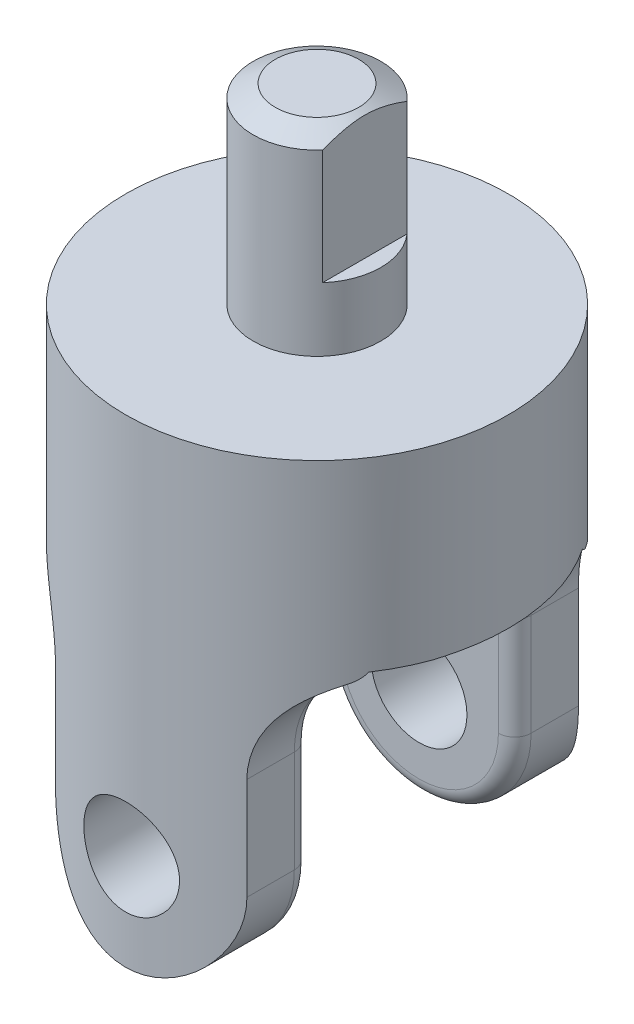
ISO-10303-21;
HEADER;
FILE_DESCRIPTION(('STEP AP214'),'2;1');
FILE_NAME('part.step','',(''),(''),'','','');
FILE_SCHEMA(('AUTOMOTIVE_DESIGN { 1 0 10303 214 1 1 1 1 }'));
ENDSEC;
DATA;
#1=APPLICATION_CONTEXT('core data for automotive mechanical design processes');
#2=APPLICATION_PROTOCOL_DEFINITION('international standard','automotive_design',2000,#1);
#3=PRODUCT_CONTEXT('',#1,'mechanical');
#4=PRODUCT('Part','Part','',(#3));
#5=PRODUCT_RELATED_PRODUCT_CATEGORY('part','',(#4));
#6=PRODUCT_DEFINITION_FORMATION('','',#4);
#7=PRODUCT_DEFINITION_CONTEXT('part definition',#1,'design');
#8=PRODUCT_DEFINITION('design','',#6,#7);
#9=PRODUCT_DEFINITION_SHAPE('','',#8);
#10=(LENGTH_UNIT() NAMED_UNIT(*) SI_UNIT(.MILLI.,.METRE.));
#11=(NAMED_UNIT(*) PLANE_ANGLE_UNIT() SI_UNIT($,.RADIAN.));
#12=(NAMED_UNIT(*) SI_UNIT($,.STERADIAN.) SOLID_ANGLE_UNIT());
#13=UNCERTAINTY_MEASURE_WITH_UNIT(LENGTH_MEASURE(1.E-05),#10,'distance_accuracy_value','');
#14=(GEOMETRIC_REPRESENTATION_CONTEXT(3) GLOBAL_UNCERTAINTY_ASSIGNED_CONTEXT((#13)) GLOBAL_UNIT_ASSIGNED_CONTEXT((#10,
#11,#12)) REPRESENTATION_CONTEXT('',''));
#15=CARTESIAN_POINT('',(0.,0.,0.));
#16=DIRECTION('',(0.,0.,1.));
#17=DIRECTION('',(1.,0.,0.));
#18=AXIS2_PLACEMENT_3D('',#15,#16,#17);
#19=CARTESIAN_POINT('',(0.,66.675,0.));
#20=DIRECTION('',(0.,-1.,0.));
#21=DIRECTION('',(0.,0.,-1.));
#22=AXIS2_PLACEMENT_3D('',#19,#20,#21);
#23=CYLINDRICAL_SURFACE('',#22,6.35);
#24=CARTESIAN_POINT('',(0.,47.625,0.));
#25=DIRECTION('',(0.,1.,0.));
#26=DIRECTION('',(0.,0.,1.));
#27=AXIS2_PLACEMENT_3D('',#24,#25,#26);
#28=CIRCLE('',#27,6.35);
#29=CARTESIAN_POINT('',(0.,47.625,6.35));
#30=VERTEX_POINT('',#29);
#31=EDGE_CURVE('E215',#30,#30,#28,.T.);
#32=ORIENTED_EDGE('',*,*,#31,.T.);
#33=EDGE_LOOP('',(#32));
#34=FACE_BOUND('',#33,.T.);
#35=DIRECTION('',(0.,1.,0.));
#36=VECTOR('',#35,1.);
#37=CARTESIAN_POINT('',(4.7625,53.975,4.20013020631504));
#38=LINE('',#37,#36);
#39=CARTESIAN_POINT('',(4.7625,53.975,4.20013020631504));
#40=VERTEX_POINT('',#39);
#41=CARTESIAN_POINT('',(4.7625,65.405,4.20013020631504));
#42=VERTEX_POINT('',#41);
#43=EDGE_CURVE('E201',#40,#42,#38,.T.);
#44=ORIENTED_EDGE('',*,*,#43,.T.);
#45=CARTESIAN_POINT('',(0.,65.405,0.));
#46=DIRECTION('',(0.,1.,0.));
#47=DIRECTION('',(0.,0.,1.));
#48=AXIS2_PLACEMENT_3D('',#45,#46,#47);
#49=CIRCLE('',#48,6.35);
#50=CARTESIAN_POINT('',(4.7625,65.405,-4.20013020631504));
#51=VERTEX_POINT('',#50);
#52=EDGE_CURVE('E60',#42,#51,#49,.F.);
#53=ORIENTED_EDGE('',*,*,#52,.T.);
#54=DIRECTION('',(0.,1.,0.));
#55=VECTOR('',#54,1.);
#56=CARTESIAN_POINT('',(4.7625,53.975,-4.20013020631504));
#57=LINE('',#56,#55);
#58=CARTESIAN_POINT('',(4.7625,53.975,-4.20013020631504));
#59=VERTEX_POINT('',#58);
#60=EDGE_CURVE('E63',#59,#51,#57,.T.);
#61=ORIENTED_EDGE('',*,*,#60,.F.);
#62=CARTESIAN_POINT('',(0.,53.975,0.));
#63=DIRECTION('',(0.,1.,0.));
#64=DIRECTION('',(0.,0.,1.));
#65=AXIS2_PLACEMENT_3D('',#62,#63,#64);
#66=CIRCLE('',#65,6.35);
#67=EDGE_CURVE('E205',#40,#59,#66,.T.);
#68=ORIENTED_EDGE('',*,*,#67,.F.);
#69=EDGE_LOOP('',(#44,#53,#61,#68));
#70=FACE_BOUND('',#69,.T.);
#71=ADVANCED_FACE('F43',(#34,#70),#23,.T.);
#72=CARTESIAN_POINT('',(0.,66.675,0.));
#73=DIRECTION('',(0.,-1.,0.));
#74=DIRECTION('',(0.,0.,-1.));
#75=AXIS2_PLACEMENT_3D('',#72,#73,#74);
#76=CONICAL_SURFACE('',#75,4.15029547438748,1.0471975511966);
#77=CARTESIAN_POINT('',(0.,66.675,0.));
#78=DIRECTION('',(0.,1.,0.));
#79=DIRECTION('',(0.,0.,1.));
#80=AXIS2_PLACEMENT_3D('',#77,#78,#79);
#81=CIRCLE('',#80,4.15029547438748);
#82=CARTESIAN_POINT('',(0.,66.675,4.15029547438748));
#83=VERTEX_POINT('',#82);
#84=EDGE_CURVE('E525',#83,#83,#81,.T.);
#85=ORIENTED_EDGE('',*,*,#84,.F.);
#86=EDGE_LOOP('',(#85));
#87=FACE_BOUND('',#86,.T.);
#88=ORIENTED_EDGE('',*,*,#52,.F.);
#89=CARTESIAN_POINT('',(4.7625,63.3576640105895,-8.67474438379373));
#90=CARTESIAN_POINT('',(4.7625,63.469711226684,-8.45330719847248));
#91=CARTESIAN_POINT('',(4.7625,63.5810014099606,-8.23148237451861));
#92=CARTESIAN_POINT('',(4.7625,63.8016576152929,-7.7868546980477));
#93=CARTESIAN_POINT('',(4.7625,63.9110234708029,-7.56405176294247));
#94=CARTESIAN_POINT('',(4.7625,64.1277386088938,-7.11660713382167));
#95=CARTESIAN_POINT('',(4.7625,64.2350805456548,-6.89196187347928));
#96=CARTESIAN_POINT('',(4.7625,64.4468042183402,-6.4412857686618));
#97=CARTESIAN_POINT('',(4.7625,64.551186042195,-6.21525496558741));
#98=CARTESIAN_POINT('',(4.7625,64.761300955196,-5.75026984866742));
#99=CARTESIAN_POINT('',(4.7625,64.8668450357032,-5.51122979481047));
#100=CARTESIAN_POINT('',(4.7625,65.0726380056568,-5.03084667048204));
#101=CARTESIAN_POINT('',(4.7625,65.1728864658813,-4.78950341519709));
#102=CARTESIAN_POINT('',(4.7625,65.3663272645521,-4.30430471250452));
#103=CARTESIAN_POINT('',(4.7625,65.4595275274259,-4.06045244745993));
#104=CARTESIAN_POINT('',(4.7625,65.6367537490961,-3.56945984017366));
#105=CARTESIAN_POINT('',(4.7625,65.7207816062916,-3.32232019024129));
#106=CARTESIAN_POINT('',(4.7625,65.8759823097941,-2.82653408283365));
#107=CARTESIAN_POINT('',(4.7625,65.9472687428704,-2.57792372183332));
#108=CARTESIAN_POINT('',(4.7625,66.0743145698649,-2.07671605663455));
#109=CARTESIAN_POINT('',(4.7625,66.1300751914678,-1.82411906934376));
#110=CARTESIAN_POINT('',(4.7625,66.2212225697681,-1.31963718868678));
#111=CARTESIAN_POINT('',(4.7625,66.2569437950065,-1.06781500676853));
#112=CARTESIAN_POINT('',(4.7625,66.2938959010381,-0.688501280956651));
#113=CARTESIAN_POINT('',(4.7625,66.3034417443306,-0.561789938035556));
#114=CARTESIAN_POINT('',(4.7625,66.3167609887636,-0.308068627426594));
#115=CARTESIAN_POINT('',(4.7625,66.3205349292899,-0.181058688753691));
#116=CARTESIAN_POINT('',(4.7625,66.3223134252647,0.0905838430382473));
#117=CARTESIAN_POINT('',(4.7625,66.3194472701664,0.235222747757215));
#118=CARTESIAN_POINT('',(4.7625,66.3061907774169,0.524155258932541));
#119=CARTESIAN_POINT('',(4.7625,66.2958001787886,0.668448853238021));
#120=CARTESIAN_POINT('',(4.7625,66.2678495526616,0.956362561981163));
#121=CARTESIAN_POINT('',(4.7625,66.2502880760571,1.09998253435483));
#122=CARTESIAN_POINT('',(4.7625,66.2085467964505,1.38625029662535));
#123=CARTESIAN_POINT('',(4.7625,66.18436689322,1.52889807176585));
#124=CARTESIAN_POINT('',(4.7625,66.1293852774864,1.81654493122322));
#125=CARTESIAN_POINT('',(4.7625,66.0984351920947,1.96151543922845));
#126=CARTESIAN_POINT('',(4.7625,66.0310411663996,2.25016667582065));
#127=CARTESIAN_POINT('',(4.7625,65.9945971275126,2.39384738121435));
#128=CARTESIAN_POINT('',(4.7625,65.9169451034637,2.67992954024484));
#129=CARTESIAN_POINT('',(4.7625,65.8757364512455,2.82233081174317));
#130=CARTESIAN_POINT('',(4.7625,65.7892365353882,3.10586895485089));
#131=CARTESIAN_POINT('',(4.7625,65.7439455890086,3.24700592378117));
#132=CARTESIAN_POINT('',(4.7625,65.6406667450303,3.55563142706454));
#133=CARTESIAN_POINT('',(4.7625,65.5819291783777,3.72286847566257));
#134=CARTESIAN_POINT('',(4.7625,65.4603269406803,4.05584009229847));
#135=CARTESIAN_POINT('',(4.7625,65.3974619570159,4.22157454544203));
#136=CARTESIAN_POINT('',(4.7625,65.2037410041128,4.71688299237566));
#137=CARTESIAN_POINT('',(4.7625,65.0677927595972,5.04446416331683));
#138=CARTESIAN_POINT('',(4.7625,64.7863691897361,5.69594921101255));
#139=CARTESIAN_POINT('',(4.7625,64.6408818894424,6.01984784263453));
#140=CARTESIAN_POINT('',(4.7625,64.3432582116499,6.66450132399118));
#141=CARTESIAN_POINT('',(4.7625,64.1911228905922,6.98525666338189));
#142=CARTESIAN_POINT('',(4.7625,63.8813253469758,7.62580230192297));
#143=CARTESIAN_POINT('',(4.7625,63.7236419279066,7.9455823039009));
#144=CARTESIAN_POINT('',(4.7625,63.4046196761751,8.58332268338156));
#145=CARTESIAN_POINT('',(4.7625,63.2432807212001,8.90128299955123));
#146=CARTESIAN_POINT('',(4.7625,62.9179416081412,9.53554216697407));
#147=CARTESIAN_POINT('',(4.7625,62.7539434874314,9.85184206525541));
#148=CARTESIAN_POINT('',(4.7625,62.4237848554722,10.4833121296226));
#149=CARTESIAN_POINT('',(4.7625,62.257624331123,10.7984822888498));
#150=CARTESIAN_POINT('',(4.7625,61.8068664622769,11.6479048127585));
#151=CARTESIAN_POINT('',(4.7625,61.5206664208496,12.181306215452));
#152=CARTESIAN_POINT('',(4.7625,60.9448108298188,13.2463803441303));
#153=CARTESIAN_POINT('',(4.7625,60.6551545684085,13.7780526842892));
#154=CARTESIAN_POINT('',(4.7625,60.0757028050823,14.8358326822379));
#155=CARTESIAN_POINT('',(4.7625,59.7859267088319,15.3619509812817));
#156=CARTESIAN_POINT('',(4.7625,59.2046035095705,16.4130517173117));
#157=CARTESIAN_POINT('',(4.7625,58.9130568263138,16.9380343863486));
#158=CARTESIAN_POINT('',(4.7625,58.620879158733,17.4626628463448));
#159=B_SPLINE_CURVE_WITH_KNOTS('',3,(#89,#90,#91,#92,#93,#94,#95,#96,#97,#98,#99,#100,#101,#102,
#103,#104,#105,#106,#107,#108,#109,#110,#111,#112,#113,#114,#115,#116,#117,#118,#119,#120,#121,
#122,#123,#124,#125,#126,#127,#128,#129,#130,#131,#132,#133,#134,#135,#136,#137,#138,#139,#140,
#141,#142,#143,#144,#145,#146,#147,#148,#149,#150,#151,#152,#153,#154,#155,#156,#157,#158),
.UNSPECIFIED.,.F.,.F.,(4,2,2,2,2,2,2,2,2,2,2,2,2,2,2,2,2,2,2,2,2,2,2,2,2,2,2,2,2,2,2,2,2,2,4),
(0.,0.744518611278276,1.48910134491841,2.23600427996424,2.98288500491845,3.76674752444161,
4.55067348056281,5.33370452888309,6.11657320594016,6.89207080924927,7.66750707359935,
8.42958338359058,8.81068147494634,9.19174395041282,9.6255420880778,10.0593552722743,
10.4932561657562,10.927163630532,11.3717539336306,11.8163522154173,12.2610128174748,
12.7056388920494,13.2373268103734,13.7690550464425,14.8328219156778,15.8979507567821,
16.9629109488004,18.0325121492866,19.102149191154,20.1710021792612,21.2398616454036,
23.0558392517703,24.8721975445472,26.6741189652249,28.4756286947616),.UNSPECIFIED.);
#160=EDGE_CURVE('E11',#42,#51,#159,.F.);
#161=ORIENTED_EDGE('',*,*,#160,.T.);
#162=EDGE_LOOP('',(#88,#161));
#163=FACE_BOUND('',#162,.T.);
#164=ADVANCED_FACE('F44',(#87,#163),#76,.T.);
#165=CARTESIAN_POINT('',(0.,47.625,0.));
#166=DIRECTION('',(0.,1.,0.));
#167=DIRECTION('',(0.,0.,1.));
#168=AXIS2_PLACEMENT_3D('',#165,#166,#167);
#169=PLANE('',#168);
#170=CARTESIAN_POINT('',(0.,47.625,0.));
#171=DIRECTION('',(0.,1.,0.));
#172=DIRECTION('',(0.,0.,1.));
#173=AXIS2_PLACEMENT_3D('',#170,#171,#172);
#174=CIRCLE('',#173,19.05);
#175=CARTESIAN_POINT('',(0.,47.625,19.05));
#176=VERTEX_POINT('',#175);
#177=EDGE_CURVE('E581',#176,#176,#174,.T.);
#178=ORIENTED_EDGE('',*,*,#177,.T.);
#179=EDGE_LOOP('',(#178));
#180=FACE_BOUND('',#179,.T.);
#181=ORIENTED_EDGE('',*,*,#31,.F.);
#182=EDGE_LOOP('',(#181));
#183=FACE_BOUND('',#182,.T.);
#184=ADVANCED_FACE('F358',(#180,#183),#169,.T.);
#185=CARTESIAN_POINT('',(0.,47.625,0.));
#186=DIRECTION('',(0.,-1.,0.));
#187=DIRECTION('',(0.,0.,-1.));
#188=AXIS2_PLACEMENT_3D('',#185,#186,#187);
#189=CYLINDRICAL_SURFACE('',#188,19.05);
#190=CARTESIAN_POINT('',(0.,14.2875,-19.05));
#191=CARTESIAN_POINT('',(-0.263131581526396,14.2874926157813,-19.0499955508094));
#192=CARTESIAN_POINT('',(-0.526345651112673,14.2656193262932,-19.0444938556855));
#193=CARTESIAN_POINT('',(-1.04523007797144,14.1788351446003,-19.0230796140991));
#194=CARTESIAN_POINT('',(-1.3008960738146,14.1138998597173,-19.0071611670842));
#195=CARTESIAN_POINT('',(-1.79711626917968,13.9432053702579,-18.966676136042));
#196=CARTESIAN_POINT('',(-2.03768821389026,13.837495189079,-18.9421199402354));
#197=CARTESIAN_POINT('',(-2.49768401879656,13.5884240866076,-18.886974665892));
#198=CARTESIAN_POINT('',(-2.71710716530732,13.4450618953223,-18.8563853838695));
#199=CARTESIAN_POINT('',(-3.13309611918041,13.121637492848,-18.7917903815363));
#200=CARTESIAN_POINT('',(-3.32916431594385,12.940945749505,-18.757731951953));
#201=CARTESIAN_POINT('',(-3.68855284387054,12.5493392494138,-18.6903874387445));
#202=CARTESIAN_POINT('',(-3.85186947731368,12.3384210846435,-18.6571014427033));
#203=CARTESIAN_POINT('',(-4.14345927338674,11.8884851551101,-18.5945391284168));
#204=CARTESIAN_POINT('',(-4.27117578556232,11.6490964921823,-18.5653297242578));
#205=CARTESIAN_POINT('',(-4.48436018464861,11.1513987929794,-18.514996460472));
#206=CARTESIAN_POINT('',(-4.56983482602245,10.8930927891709,-18.4938713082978));
#207=CARTESIAN_POINT('',(-4.69441160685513,10.3703643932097,-18.4626401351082));
#208=CARTESIAN_POINT('',(-4.73440845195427,10.1061682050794,-18.4523218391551));
#209=CARTESIAN_POINT('',(-4.76968113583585,9.57462979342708,-18.443237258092));
#210=CARTESIAN_POINT('',(-4.7649642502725,9.30728808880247,-18.4444690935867));
#211=CARTESIAN_POINT('',(-4.71165721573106,8.78390481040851,-18.4581547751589));
#212=CARTESIAN_POINT('',(-4.66413323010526,8.52774640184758,-18.4703359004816));
#213=CARTESIAN_POINT('',(-4.528261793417,8.02715866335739,-18.5041130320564));
#214=CARTESIAN_POINT('',(-4.43991143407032,7.78273017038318,-18.5257097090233));
#215=CARTESIAN_POINT('',(-4.22398659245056,7.30968179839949,-18.5761348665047));
#216=CARTESIAN_POINT('',(-4.09602516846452,7.08124640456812,-18.6050341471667));
#217=CARTESIAN_POINT('',(-3.80478117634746,6.6487080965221,-18.6667683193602));
#218=CARTESIAN_POINT('',(-3.64149242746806,6.44460944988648,-18.6996038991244));
#219=CARTESIAN_POINT('',(-3.27870637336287,6.06042852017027,-18.7666592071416));
#220=CARTESIAN_POINT('',(-3.07830936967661,5.88119699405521,-18.8008917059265));
#221=CARTESIAN_POINT('',(-2.64989283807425,5.55872255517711,-18.8660394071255));
#222=CARTESIAN_POINT('',(-2.42187246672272,5.41548074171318,-18.8969545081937));
#223=CARTESIAN_POINT('',(-1.94346794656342,5.16873938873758,-18.9521379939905));
#224=CARTESIAN_POINT('',(-1.69300967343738,5.06537804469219,-18.9763831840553));
#225=CARTESIAN_POINT('',(-1.17753132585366,4.90246255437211,-19.0153263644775));
#226=CARTESIAN_POINT('',(-0.912514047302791,4.84290002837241,-19.0300261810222));
#227=CARTESIAN_POINT('',(-0.382714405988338,4.77057222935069,-19.0479521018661));
#228=CARTESIAN_POINT('',(-0.11809958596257,4.75664839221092,-19.0514621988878));
#229=CARTESIAN_POINT('',(0.409679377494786,4.77281558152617,-19.0474220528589));
#230=CARTESIAN_POINT('',(0.67284364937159,4.80290264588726,-19.0398728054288));
#231=CARTESIAN_POINT('',(1.18622530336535,4.90528263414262,-19.0147442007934));
#232=CARTESIAN_POINT('',(1.43657675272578,4.97694351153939,-18.9973151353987));
#233=CARTESIAN_POINT('',(1.92169190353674,5.15971499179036,-18.9543914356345));
#234=CARTESIAN_POINT('',(2.15645402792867,5.27082957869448,-18.928895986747));
#235=CARTESIAN_POINT('',(2.60833595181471,5.5315997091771,-18.8719875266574));
#236=CARTESIAN_POINT('',(2.82506877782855,5.6819041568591,-18.8404775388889));
#237=CARTESIAN_POINT('',(3.23064699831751,6.015957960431,-18.7751881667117));
#238=CARTESIAN_POINT('',(3.41948756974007,6.19971308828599,-18.7414083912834));
#239=CARTESIAN_POINT('',(3.76869505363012,6.60083122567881,-18.6743643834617));
#240=CARTESIAN_POINT('',(3.92824927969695,6.81890845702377,-18.6411331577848));
#241=CARTESIAN_POINT('',(4.20849665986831,7.27942611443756,-18.5798738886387));
#242=CARTESIAN_POINT('',(4.32919153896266,7.5218654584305,-18.5518456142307));
#243=CARTESIAN_POINT('',(4.5273957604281,8.02292566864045,-18.5044745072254));
#244=CARTESIAN_POINT('',(4.60516095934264,8.28144021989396,-18.4850803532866));
#245=CARTESIAN_POINT('',(4.71597247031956,8.80843310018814,-18.457124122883));
#246=CARTESIAN_POINT('',(4.7490285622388,9.0769092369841,-18.4485596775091));
#247=CARTESIAN_POINT('',(4.76897252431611,9.6079342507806,-18.4434131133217));
#248=CARTESIAN_POINT('',(4.75715932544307,9.87043185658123,-18.4464938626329));
#249=CARTESIAN_POINT('',(4.69067285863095,10.3895648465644,-18.4635111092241));
#250=CARTESIAN_POINT('',(4.63600045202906,10.6462003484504,-18.4774473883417));
#251=CARTESIAN_POINT('',(4.48605693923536,11.1449118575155,-18.5144175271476));
#252=CARTESIAN_POINT('',(4.39102945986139,11.3870654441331,-18.5373967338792));
#253=CARTESIAN_POINT('',(4.1632661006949,11.8521650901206,-18.5898712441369));
#254=CARTESIAN_POINT('',(4.03052499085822,12.0751084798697,-18.6193674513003));
#255=CARTESIAN_POINT('',(3.72703010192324,12.5017359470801,-18.6825138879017));
#256=CARTESIAN_POINT('',(3.5553750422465,12.7047659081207,-18.7162524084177));
#257=CARTESIAN_POINT('',(3.18068125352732,13.0795618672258,-18.7835548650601));
#258=CARTESIAN_POINT('',(2.97763508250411,13.2513204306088,-18.8171187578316));
#259=CARTESIAN_POINT('',(2.54148458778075,13.5617309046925,-18.8810155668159));
#260=CARTESIAN_POINT('',(2.30790249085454,13.6997268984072,-18.911278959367));
#261=CARTESIAN_POINT('',(1.82011973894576,13.9342731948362,-18.9644313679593));
#262=CARTESIAN_POINT('',(1.56593401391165,14.0308531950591,-18.9873256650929));
#263=CARTESIAN_POINT('',(1.09350255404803,14.1654905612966,-19.0197758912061));
#264=CARTESIAN_POINT('',(0.877507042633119,14.2111451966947,-19.031032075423));
#265=CARTESIAN_POINT('',(0.441026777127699,14.2721518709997,-19.0461457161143));
#266=CARTESIAN_POINT('',(0.220542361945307,14.2875061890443,-19.0500037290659));
#267=CARTESIAN_POINT('',(0.,14.2875,-19.05));
#268=B_SPLINE_CURVE_WITH_KNOTS('',3,(#190,#191,#192,#193,#194,#195,#196,#197,#198,#199,#200,
#201,#202,#203,#204,#205,#206,#207,#208,#209,#210,#211,#212,#213,#214,#215,#216,#217,#218,#219,
#220,#221,#222,#223,#224,#225,#226,#227,#228,#229,#230,#231,#232,#233,#234,#235,#236,#237,#238,
#239,#240,#241,#242,#243,#244,#245,#246,#247,#248,#249,#250,#251,#252,#253,#254,#255,#256,#257,
#258,#259,#260,#261,#262,#263,#264,#265,#266,#267),.UNSPECIFIED.,.T.,.F.,(4,2,2,2,2,2,2,2,2,2,2,
2,2,2,2,2,2,2,2,2,2,2,2,2,2,2,2,2,2,2,2,2,2,2,2,2,2,2,4),(0.,0.788586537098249,1.57762015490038,
2.36570806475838,3.15382256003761,3.95650832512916,4.75928466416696,5.57398705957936,
6.38855914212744,7.18681236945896,7.98493571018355,8.76371428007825,9.54254833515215,
10.3292442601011,11.1160779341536,11.9253476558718,12.7346420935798,13.5467162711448,
14.3586350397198,15.1497763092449,15.940846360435,16.7201937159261,17.4996197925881,
18.2928764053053,19.08627002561,19.8991381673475,20.7119702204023,21.5199040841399,
22.3276611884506,23.1122150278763,23.8967531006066,24.6766207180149,25.4565965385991,
26.2569190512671,27.0574315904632,27.8724418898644,28.6868668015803,29.3478662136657,
30.008815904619),.UNSPECIFIED.);
#269=CARTESIAN_POINT('',(0.,14.2875,-19.05));
#270=VERTEX_POINT('',#269);
#271=EDGE_CURVE('E229',#270,#270,#268,.T.);
#272=ORIENTED_EDGE('',*,*,#271,.T.);
#273=EDGE_LOOP('',(#272));
#274=FACE_BOUND('',#273,.T.);
#275=CARTESIAN_POINT('',(4.7625,9.525,18.4450831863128));
#276=CARTESIAN_POINT('',(4.7624925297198,9.26201331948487,18.4450882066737));
#277=CARTESIAN_POINT('',(4.74064249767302,8.99894396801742,18.4507690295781));
#278=CARTESIAN_POINT('',(4.65395905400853,8.48035976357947,18.4728204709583));
#279=CARTESIAN_POINT('',(4.58910062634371,8.22484939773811,18.4891973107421));
#280=CARTESIAN_POINT('',(4.41863073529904,7.72895925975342,18.5306727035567));
#281=CARTESIAN_POINT('',(4.31307188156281,7.48856041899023,18.5557599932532));
#282=CARTESIAN_POINT('',(4.06435777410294,7.02885782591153,18.6118155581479));
#283=CARTESIAN_POINT('',(3.92120092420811,6.80955496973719,18.6427840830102));
#284=CARTESIAN_POINT('',(3.59798955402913,6.39344356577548,18.7078756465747));
#285=CARTESIAN_POINT('',(3.41725927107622,6.19716769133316,18.7420490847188));
#286=CARTESIAN_POINT('',(3.02548683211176,5.83737454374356,18.8092627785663));
#287=CARTESIAN_POINT('',(2.81444184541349,5.67386033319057,18.8423029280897));
#288=CARTESIAN_POINT('',(2.36438160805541,5.38205273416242,18.9040849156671));
#289=CARTESIAN_POINT('',(2.12501716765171,5.25428263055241,18.9327603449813));
#290=CARTESIAN_POINT('',(1.62737136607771,5.04099262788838,18.98200696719));
#291=CARTESIAN_POINT('',(1.36909280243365,4.95546649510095,19.0025793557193));
#292=CARTESIAN_POINT('',(0.846503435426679,4.8307983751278,19.0329456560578));
#293=CARTESIAN_POINT('',(0.582420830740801,4.79075182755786,19.0429494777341));
#294=CARTESIAN_POINT('',(0.0511089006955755,4.75534028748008,19.0517829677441));
#295=CARTESIAN_POINT('',(-0.216119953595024,4.75996868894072,19.0506142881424));
#296=CARTESIAN_POINT('',(-0.739865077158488,4.81312508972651,19.0373907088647));
#297=CARTESIAN_POINT('',(-0.996487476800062,4.86067669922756,19.0255779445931));
#298=CARTESIAN_POINT('',(-1.4979884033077,4.99676026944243,18.992675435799));
#299=CARTESIAN_POINT('',(-1.74286630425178,5.08529441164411,18.9715851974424));
#300=CARTESIAN_POINT('',(-2.21649942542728,5.30161989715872,18.9221270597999));
#301=CARTESIAN_POINT('',(-2.44508897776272,5.42975872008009,18.8936951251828));
#302=CARTESIAN_POINT('',(-2.87786265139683,5.72139256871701,18.8326376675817));
#303=CARTESIAN_POINT('',(-3.08204251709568,5.88489374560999,18.8000114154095));
#304=CARTESIAN_POINT('',(-3.46602384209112,6.24784515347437,18.733078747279));
#305=CARTESIAN_POINT('',(-3.6450159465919,6.44814856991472,18.6987507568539));
#306=CARTESIAN_POINT('',(-3.96704999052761,6.87628794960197,18.6330915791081));
#307=CARTESIAN_POINT('',(-4.11009024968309,7.10412519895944,18.6017605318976));
#308=CARTESIAN_POINT('',(-4.35667846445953,7.58245251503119,18.5455654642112));
#309=CARTESIAN_POINT('',(-4.46003156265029,7.8330470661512,18.5207335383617));
#310=CARTESIAN_POINT('',(-4.6228902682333,8.34882531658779,18.4807600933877));
#311=CARTESIAN_POINT('',(-4.68240525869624,8.61400588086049,18.4656165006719));
#312=CARTESIAN_POINT('',(-4.75455546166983,9.14392285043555,18.4471695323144));
#313=CARTESIAN_POINT('',(-4.76838735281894,9.40848599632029,18.4435639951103));
#314=CARTESIAN_POINT('',(-4.75205486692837,9.93614078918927,18.4477788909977));
#315=CARTESIAN_POINT('',(-4.72189453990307,10.1992325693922,18.4555982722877));
#316=CARTESIAN_POINT('',(-4.61948300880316,10.7120326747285,18.4814924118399));
#317=CARTESIAN_POINT('',(-4.54792855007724,10.9618895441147,18.4993972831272));
#318=CARTESIAN_POINT('',(-4.36553244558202,11.4460619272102,18.5432836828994));
#319=CARTESIAN_POINT('',(-4.25468614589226,11.6803755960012,18.5692661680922));
#320=CARTESIAN_POINT('',(-3.99434812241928,12.1318806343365,18.6270164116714));
#321=CARTESIAN_POINT('',(-3.84414094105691,12.3486459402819,18.6588876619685));
#322=CARTESIAN_POINT('',(-3.51024964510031,12.7543338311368,18.7245704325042));
#323=CARTESIAN_POINT('',(-3.3265600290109,12.9432518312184,18.7583822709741));
#324=CARTESIAN_POINT('',(-2.92542620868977,13.2927300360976,18.8251605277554));
#325=CARTESIAN_POINT('',(-2.70725242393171,13.4524624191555,18.8580846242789));
#326=CARTESIAN_POINT('',(-2.24648402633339,13.7330228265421,18.9185019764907));
#327=CARTESIAN_POINT('',(-2.00389068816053,13.8538528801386,18.9459955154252));
#328=CARTESIAN_POINT('',(-1.50284593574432,14.0521296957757,18.9922807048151));
#329=CARTESIAN_POINT('',(-1.24452402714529,14.1298884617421,19.0111347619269));
#330=CARTESIAN_POINT('',(-0.717945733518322,14.240751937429,19.0382898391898));
#331=CARTESIAN_POINT('',(-0.449691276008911,14.2738652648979,19.0465928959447));
#332=CARTESIAN_POINT('',(0.0813602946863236,14.2940131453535,19.0516273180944));
#333=CARTESIAN_POINT('',(0.344108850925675,14.2822693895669,19.0486654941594));
#334=CARTESIAN_POINT('',(0.863762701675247,14.2158347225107,19.0321833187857));
#335=CARTESIAN_POINT('',(1.12066816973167,14.1611450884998,19.0186632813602));
#336=CARTESIAN_POINT('',(1.62006455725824,14.0110263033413,18.9826312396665));
#337=CARTESIAN_POINT('',(1.86262563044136,13.9158180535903,18.9601680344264));
#338=CARTESIAN_POINT('',(2.32846746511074,13.6875651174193,18.908615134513));
#339=CARTESIAN_POINT('',(2.55174579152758,13.5545156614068,18.8795246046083));
#340=CARTESIAN_POINT('',(2.97847668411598,13.2506311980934,18.8169827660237));
#341=CARTESIAN_POINT('',(3.18132613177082,13.0789673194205,18.7834436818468));
#342=CARTESIAN_POINT('',(3.55575403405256,12.7043361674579,18.7161796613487));
#343=CARTESIAN_POINT('',(3.72732454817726,12.5013609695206,18.6824546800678));
#344=CARTESIAN_POINT('',(4.0374666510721,12.0653107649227,18.6179210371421));
#345=CARTESIAN_POINT('',(4.1753628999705,11.831744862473,18.5871785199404));
#346=CARTESIAN_POINT('',(4.4097268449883,11.3440107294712,18.5329808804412));
#347=CARTESIAN_POINT('',(4.50622468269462,11.0898576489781,18.5095204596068));
#348=CARTESIAN_POINT('',(4.6406872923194,10.617626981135,18.4762096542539));
#349=CARTESIAN_POINT('',(4.68626747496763,10.401808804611,18.4646250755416));
#350=CARTESIAN_POINT('',(4.74717566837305,9.96567951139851,18.4490600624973));
#351=CARTESIAN_POINT('',(4.76250625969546,9.74536877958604,18.4450789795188));
#352=CARTESIAN_POINT('',(4.7625,9.525,18.4450831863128));
#353=B_SPLINE_CURVE_WITH_KNOTS('',3,(#275,#276,#277,#278,#279,#280,#281,#282,#283,#284,#285,
#286,#287,#288,#289,#290,#291,#292,#293,#294,#295,#296,#297,#298,#299,#300,#301,#302,#303,#304,
#305,#306,#307,#308,#309,#310,#311,#312,#313,#314,#315,#316,#317,#318,#319,#320,#321,#322,#323,
#324,#325,#326,#327,#328,#329,#330,#331,#332,#333,#334,#335,#336,#337,#338,#339,#340,#341,#342,
#343,#344,#345,#346,#347,#348,#349,#350,#351,#352),.UNSPECIFIED.,.T.,.F.,(4,2,2,2,2,2,2,2,2,2,2,
2,2,2,2,2,2,2,2,2,2,2,2,2,2,2,2,2,2,2,2,2,2,2,2,2,2,2,4),(0.,0.788150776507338,1.57676038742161,
2.36435403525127,3.15198112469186,3.95523632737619,4.75856658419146,5.57310600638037,
6.3875251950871,7.18544570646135,7.98324823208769,8.76334790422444,9.54348910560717,
10.3306792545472,11.1180064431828,11.9266423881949,12.7353161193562,13.5479110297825,
14.3603319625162,15.1512950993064,15.9421854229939,16.7201355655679,17.4981778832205,
18.2914832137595,19.0849190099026,19.8982075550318,20.7114536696,21.5187289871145,
22.3258484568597,23.1111446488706,23.896417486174,24.677462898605,25.4586067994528,
26.258464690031,27.0585253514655,27.8735118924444,28.6879040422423,29.3483886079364,
30.0088168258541),.UNSPECIFIED.);
#354=CARTESIAN_POINT('',(4.7625,9.525,18.4450831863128));
#355=VERTEX_POINT('',#354);
#356=EDGE_CURVE('E225',#355,#355,#353,.T.);
#357=ORIENTED_EDGE('',*,*,#356,.T.);
#358=EDGE_LOOP('',(#357));
#359=FACE_BOUND('',#358,.T.);
#360=ORIENTED_EDGE('',*,*,#177,.F.);
#361=EDGE_LOOP('',(#360));
#362=FACE_BOUND('',#361,.T.);
#363=CARTESIAN_POINT('',(0.,29.1452388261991,0.));
#364=DIRECTION('',(0.,1.,0.));
#365=DIRECTION('',(0.,0.,1.));
#366=AXIS2_PLACEMENT_3D('',#363,#364,#365);
#367=CIRCLE('',#366,19.05);
#368=CARTESIAN_POINT('',(-17.9411689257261,29.1452388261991,6.40444826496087));
#369=VERTEX_POINT('',#368);
#370=CARTESIAN_POINT('',(-15.8045091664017,29.1452388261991,10.6357881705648));
#371=VERTEX_POINT('',#370);
#372=EDGE_CURVE('E590',#369,#371,#367,.T.);
#373=ORIENTED_EDGE('',*,*,#372,.T.);
#374=CARTESIAN_POINT('',(-15.8045091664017,29.1452388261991,10.6357881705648));
#375=CARTESIAN_POINT('',(-15.7780681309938,29.0946170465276,10.6750805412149));
#376=CARTESIAN_POINT('',(-15.7503808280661,29.0459076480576,10.7159048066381));
#377=CARTESIAN_POINT('',(-15.6927265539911,28.9523121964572,10.800158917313));
#378=CARTESIAN_POINT('',(-15.6627613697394,28.9074232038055,10.8435867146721));
#379=CARTESIAN_POINT('',(-15.5707593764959,28.7798361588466,10.9756682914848));
#380=CARTESIAN_POINT('',(-15.5057022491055,28.7025004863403,11.0674874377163));
#381=CARTESIAN_POINT('',(-15.4017758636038,28.5961638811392,11.2112221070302));
#382=CARTESIAN_POINT('',(-15.3653620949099,28.5618065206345,11.2610876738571));
#383=CARTESIAN_POINT('',(-15.2908203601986,28.4970323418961,11.3620968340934));
#384=CARTESIAN_POINT('',(-15.252692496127,28.4666152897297,11.4132403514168));
#385=CARTESIAN_POINT('',(-15.1741618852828,28.409298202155,11.5174494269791));
#386=CARTESIAN_POINT('',(-15.1337308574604,28.3824697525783,11.5705329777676));
#387=CARTESIAN_POINT('',(-15.0513365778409,28.3331349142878,11.677514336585));
#388=CARTESIAN_POINT('',(-15.0093732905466,28.3106286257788,11.731412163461));
#389=CARTESIAN_POINT('',(-14.9667007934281,28.2903641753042,11.7856));
#390=B_SPLINE_CURVE_WITH_KNOTS('',3,(#374,#375,#376,#377,#378,#379,#380,#381,#382,#383,#384,
#385,#386,#387,#388,#389),.UNSPECIFIED.,.F.,.F.,(4,2,2,2,2,2,2,4),(0.,0.207821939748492,
0.415482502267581,0.823732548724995,1.03561238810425,1.24747964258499,1.46308796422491,
1.67870128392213),.UNSPECIFIED.);
#391=CARTESIAN_POINT('',(-14.9667007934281,28.2903641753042,11.7856));
#392=VERTEX_POINT('',#391);
#393=EDGE_CURVE('E323',#371,#392,#390,.T.);
#394=ORIENTED_EDGE('',*,*,#393,.T.);
#395=CARTESIAN_POINT('',(-9.525,19.685,-16.4977839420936));
#396=CARTESIAN_POINT('',(-9.52496088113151,19.918350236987,-16.4977688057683));
#397=CARTESIAN_POINT('',(-9.53357353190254,20.1516967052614,-16.4928328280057));
#398=CARTESIAN_POINT('',(-9.56782146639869,20.6166980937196,-16.4730087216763));
#399=CARTESIAN_POINT('',(-9.59345572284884,20.8483531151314,-16.4581211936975));
#400=CARTESIAN_POINT('',(-9.66141942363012,21.3080009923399,-16.4183108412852));
#401=CARTESIAN_POINT('',(-9.70372594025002,21.5359984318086,-16.3934017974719));
#402=CARTESIAN_POINT('',(-9.80447669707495,21.9870210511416,-16.3333461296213));
#403=CARTESIAN_POINT('',(-9.86292069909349,22.2100463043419,-16.2981996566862));
#404=CARTESIAN_POINT('',(-9.99521577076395,22.6496636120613,-16.217402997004));
#405=CARTESIAN_POINT('',(-10.0690752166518,22.8662520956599,-16.1717470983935));
#406=CARTESIAN_POINT('',(-10.2311827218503,23.2913603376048,-16.0696785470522));
#407=CARTESIAN_POINT('',(-10.3194309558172,23.4998799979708,-16.0132657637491));
#408=CARTESIAN_POINT('',(-10.5090589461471,23.9073731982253,-15.8894615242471));
#409=CARTESIAN_POINT('',(-10.6104339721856,24.1063501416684,-15.8220740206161));
#410=CARTESIAN_POINT('',(-10.8249101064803,24.4935871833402,-15.676116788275));
#411=CARTESIAN_POINT('',(-10.9380111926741,24.6818473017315,-15.597547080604));
#412=CARTESIAN_POINT('',(-11.1750060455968,25.0476354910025,-15.4286429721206));
#413=CARTESIAN_POINT('',(-11.2989577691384,25.2250961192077,-15.3382439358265));
#414=CARTESIAN_POINT('',(-11.5553164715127,25.5672655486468,-15.1460495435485));
#415=CARTESIAN_POINT('',(-11.6877234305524,25.7319743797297,-15.0442542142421));
#416=CARTESIAN_POINT('',(-11.9591574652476,26.0480960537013,-14.8293967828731));
#417=CARTESIAN_POINT('',(-12.0981857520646,26.1995064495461,-14.7163326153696));
#418=CARTESIAN_POINT('',(-12.3809708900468,26.4887188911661,-14.4792302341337));
#419=CARTESIAN_POINT('',(-12.5247282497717,26.6265194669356,-14.3551908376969));
#420=CARTESIAN_POINT('',(-12.8240785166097,26.8965620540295,-14.0885806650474));
#421=CARTESIAN_POINT('',(-12.9798547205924,27.0279377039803,-13.9453388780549));
#422=CARTESIAN_POINT('',(-13.292575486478,27.2756182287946,-13.6475843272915));
#423=CARTESIAN_POINT('',(-13.4495200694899,27.3919228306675,-13.4930713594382));
#424=CARTESIAN_POINT('',(-13.7627279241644,27.6100750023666,-13.1734537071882));
#425=CARTESIAN_POINT('',(-13.91899104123,27.7119194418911,-13.0083467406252));
#426=CARTESIAN_POINT('',(-14.2291584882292,27.9019462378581,-12.6683290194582));
#427=CARTESIAN_POINT('',(-14.3830623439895,27.9901258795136,-12.4934163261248));
#428=CARTESIAN_POINT('',(-14.7634251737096,28.1948863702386,-12.0444336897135));
#429=CARTESIAN_POINT('',(-14.9875078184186,28.3034922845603,-11.7646791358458));
#430=CARTESIAN_POINT('',(-15.4232003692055,28.4957157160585,-11.1874194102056));
#431=CARTESIAN_POINT('',(-15.6348051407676,28.5793230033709,-10.8899070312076));
#432=CARTESIAN_POINT('',(-16.0431146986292,28.7255421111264,-10.2789237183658));
#433=CARTESIAN_POINT('',(-16.2397846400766,28.7881059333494,-9.96541815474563));
#434=CARTESIAN_POINT('',(-16.615638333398,28.8957388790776,-9.3252837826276));
#435=CARTESIAN_POINT('',(-16.7948218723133,28.9408077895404,-8.99865481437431));
#436=CARTESIAN_POINT('',(-17.1918461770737,29.029905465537,-8.22145899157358));
#437=CARTESIAN_POINT('',(-17.4021973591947,29.0684013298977,-7.76641658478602));
#438=CARTESIAN_POINT('',(-17.786699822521,29.1278564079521,-6.84014068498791));
#439=CARTESIAN_POINT('',(-17.9608394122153,29.1488099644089,-6.36890201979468));
#440=CARTESIAN_POINT('',(-18.2714417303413,29.1794105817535,-5.41378881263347));
#441=CARTESIAN_POINT('',(-18.4079009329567,29.1890565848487,-4.92991309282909));
#442=CARTESIAN_POINT('',(-18.6421466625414,29.2019870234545,-3.95287775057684));
#443=CARTESIAN_POINT('',(-18.7399368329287,29.2052720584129,-3.45971900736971));
#444=CARTESIAN_POINT('',(-18.897358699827,29.2091078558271,-2.4600813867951));
#445=CARTESIAN_POINT('',(-18.9564226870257,29.2096187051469,-1.95351291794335));
#446=CARTESIAN_POINT('',(-19.033752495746,29.2100647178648,-0.937263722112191));
#447=CARTESIAN_POINT('',(-19.0520174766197,29.209999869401,-0.427582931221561));
#448=CARTESIAN_POINT('',(-19.0476285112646,29.2100001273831,0.591825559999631));
#449=CARTESIAN_POINT('',(-19.0249568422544,29.2100652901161,1.10155318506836));
#450=CARTESIAN_POINT('',(-18.9388075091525,29.2094475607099,2.11754548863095));
#451=CARTESIAN_POINT('',(-18.8753295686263,29.2087646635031,2.62381014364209));
#452=CARTESIAN_POINT('',(-18.7036160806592,29.2041086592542,3.65580332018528));
#453=CARTESIAN_POINT('',(-18.5932233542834,29.1999661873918,4.18117378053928));
#454=CARTESIAN_POINT('',(-18.3285057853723,29.1835599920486,5.2207365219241));
#455=CARTESIAN_POINT('',(-18.1741722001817,29.1712946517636,5.73492655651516));
#456=CARTESIAN_POINT('',(-17.8230306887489,29.1322930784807,6.74751648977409));
#457=CARTESIAN_POINT('',(-17.6262637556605,29.1055707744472,7.24593109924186));
#458=CARTESIAN_POINT('',(-17.1921907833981,29.0296619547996,8.22291578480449));
#459=CARTESIAN_POINT('',(-16.9549063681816,28.9804873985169,8.7014962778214));
#460=CARTESIAN_POINT('',(-16.5317482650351,28.8726944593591,9.47232063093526));
#461=CARTESIAN_POINT('',(-16.356505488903,28.8232353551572,9.77172744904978));
#462=CARTESIAN_POINT('',(-15.9915321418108,28.7076409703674,10.3582119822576));
#463=CARTESIAN_POINT('',(-15.8018055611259,28.6415102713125,10.6452930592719));
#464=CARTESIAN_POINT('',(-15.4100602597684,28.4895738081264,11.2048655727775));
#465=CARTESIAN_POINT('',(-15.2080616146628,28.4037995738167,11.4773795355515));
#466=CARTESIAN_POINT('',(-14.794100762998,28.2093882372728,12.0062371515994));
#467=CARTESIAN_POINT('',(-14.5821407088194,28.1007560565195,12.2625842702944));
#468=CARTESIAN_POINT('',(-14.1961331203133,27.8828084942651,12.7059055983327));
#469=CARTESIAN_POINT('',(-14.0232896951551,27.7782615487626,12.8962780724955));
#470=CARTESIAN_POINT('',(-13.6756323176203,27.5516907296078,13.2643740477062));
#471=CARTESIAN_POINT('',(-13.5008188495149,27.4296710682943,13.4421005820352));
#472=CARTESIAN_POINT('',(-13.1516762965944,27.1671845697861,13.7838888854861));
#473=CARTESIAN_POINT('',(-12.9773471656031,27.0267195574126,13.947952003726));
#474=CARTESIAN_POINT('',(-12.6319391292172,26.726763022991,14.2615225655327));
#475=CARTESIAN_POINT('',(-12.4608602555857,26.5672713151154,14.4110298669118));
#476=CARTESIAN_POINT('',(-12.1237135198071,26.2279198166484,14.6958204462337));
#477=CARTESIAN_POINT('',(-11.9576926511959,26.0479167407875,14.8309890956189));
#478=CARTESIAN_POINT('',(-11.6351953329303,25.6689938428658,15.0853214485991));
#479=CARTESIAN_POINT('',(-11.4787191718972,25.4700734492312,15.2044846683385));
#480=CARTESIAN_POINT('',(-11.1784747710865,25.0543983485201,15.4265708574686));
#481=CARTESIAN_POINT('',(-11.0347050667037,24.8376457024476,15.5294956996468));
#482=CARTESIAN_POINT('',(-10.7628059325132,24.3878782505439,15.7191604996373));
#483=CARTESIAN_POINT('',(-10.6346741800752,24.154865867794,15.8059028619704));
#484=CARTESIAN_POINT('',(-10.4115375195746,23.7046522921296,15.9536199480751));
#485=CARTESIAN_POINT('',(-10.3143937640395,23.4891174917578,16.0164604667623));
#486=CARTESIAN_POINT('',(-10.1355425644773,23.04871010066,16.1302361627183));
#487=CARTESIAN_POINT('',(-10.0538339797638,22.8238382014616,16.181172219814));
#488=CARTESIAN_POINT('',(-9.90713729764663,22.3666546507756,16.2714028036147));
#489=CARTESIAN_POINT('',(-9.84213485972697,22.1343495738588,16.3107073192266));
#490=CARTESIAN_POINT('',(-9.72972257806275,21.6640173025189,16.3780123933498));
#491=CARTESIAN_POINT('',(-9.6823065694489,21.4259921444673,16.4060169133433));
#492=CARTESIAN_POINT('',(-9.60449707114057,20.9383691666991,16.4516946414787));
#493=CARTESIAN_POINT('',(-9.57468865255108,20.6886433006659,16.4690135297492));
#494=CARTESIAN_POINT('',(-9.54488066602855,20.3127872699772,16.48629321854));
#495=CARTESIAN_POINT('',(-9.5374287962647,20.1873921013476,16.4906033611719));
#496=CARTESIAN_POINT('',(-9.52748802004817,19.9363374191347,16.4963477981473));
#497=CARTESIAN_POINT('',(-9.52499919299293,19.8106779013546,16.4977820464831));
#498=CARTESIAN_POINT('',(-9.525,19.685,16.4977839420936));
#499=B_SPLINE_CURVE_WITH_KNOTS('',3,(#395,#396,#397,#398,#399,#400,#401,#402,#403,#404,#405,
#406,#407,#408,#409,#410,#411,#412,#413,#414,#415,#416,#417,#418,#419,#420,#421,#422,#423,#424,
#425,#426,#427,#428,#429,#430,#431,#432,#433,#434,#435,#436,#437,#438,#439,#440,#441,#442,#443,
#444,#445,#446,#447,#448,#449,#450,#451,#452,#453,#454,#455,#456,#457,#458,#459,#460,#461,#462,
#463,#464,#465,#466,#467,#468,#469,#470,#471,#472,#473,#474,#475,#476,#477,#478,#479,#480,#481,
#482,#483,#484,#485,#486,#487,#488,#489,#490,#491,#492,#493,#494,#495,#496,#497,#498),
.UNSPECIFIED.,.F.,.F.,(4,2,2,2,2,2,2,2,2,2,2,2,2,2,2,2,2,2,2,2,2,2,2,2,2,2,2,2,2,2,2,2,2,2,2,2,
2,2,2,2,2,2,2,2,2,2,2,2,2,2,2,4),(0.,0.699834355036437,1.39962647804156,2.09845958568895,
2.79728237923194,3.49648588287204,4.19569787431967,4.8946585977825,5.59361800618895,
6.29656980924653,6.99951996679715,7.70259920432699,8.40575429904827,9.15225685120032,
9.89877292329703,10.6454503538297,11.3922759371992,12.514141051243,13.6364646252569,
14.7613310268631,15.8862111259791,17.392458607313,18.899191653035,20.40606563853,
21.9127976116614,23.4411511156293,24.9695361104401,26.4985829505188,28.0276401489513,
29.6362655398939,31.2452112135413,32.852609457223,34.4591525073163,35.50965675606,
36.5598726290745,37.6084144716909,38.6567307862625,39.4886840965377,40.3204371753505,
41.1521080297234,41.9837870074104,42.8216802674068,43.6595988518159,44.4974207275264,
45.3351180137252,46.0680642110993,46.8009562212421,47.5332170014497,48.2652208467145,
49.02034913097,49.3973072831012,49.7742714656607),.UNSPECIFIED.);
#500=CARTESIAN_POINT('',(-9.525,19.685,16.4977839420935));
#501=VERTEX_POINT('',#500);
#502=EDGE_CURVE('E393',#392,#501,#499,.T.);
#503=ORIENTED_EDGE('',*,*,#502,.T.);
#504=DIRECTION('',(0.,-1.,0.));
#505=VECTOR('',#504,1.);
#506=CARTESIAN_POINT('',(-9.52499999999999,47.625,16.4977839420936));
#507=LINE('',#506,#505);
#508=CARTESIAN_POINT('',(-9.525,9.525,16.4977839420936));
#509=VERTEX_POINT('',#508);
#510=EDGE_CURVE('E394',#501,#509,#507,.T.);
#511=ORIENTED_EDGE('',*,*,#510,.T.);
#512=CARTESIAN_POINT('',(9.525,9.525,16.4977839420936));
#513=CARTESIAN_POINT('',(9.52500093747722,9.40027257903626,16.4977810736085));
#514=CARTESIAN_POINT('',(9.5225495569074,9.27556275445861,16.4991989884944));
#515=CARTESIAN_POINT('',(9.51275833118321,9.02640408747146,16.504847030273));
#516=CARTESIAN_POINT('',(9.50541869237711,8.90195523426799,16.5090770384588));
#517=CARTESIAN_POINT('',(9.47610793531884,8.52953393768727,16.5259318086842));
#518=CARTESIAN_POINT('',(9.4468449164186,8.28227418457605,16.5427214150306));
#519=CARTESIAN_POINT('',(9.36949132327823,7.79316834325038,16.5866536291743));
#520=CARTESIAN_POINT('',(9.32150961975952,7.55129934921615,16.6137363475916));
#521=CARTESIAN_POINT('',(9.20730560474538,7.07314911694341,16.6772985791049));
#522=CARTESIAN_POINT('',(9.14108119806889,6.83686852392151,16.7137791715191));
#523=CARTESIAN_POINT('',(8.99129510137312,6.37194751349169,16.7948306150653));
#524=CARTESIAN_POINT('',(8.90777526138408,6.14329017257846,16.8393819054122));
#525=CARTESIAN_POINT('',(8.72407711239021,5.69420111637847,16.9352799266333));
#526=CARTESIAN_POINT('',(8.62389244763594,5.47377257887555,16.9866292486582));
#527=CARTESIAN_POINT('',(8.29930376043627,4.82601405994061,17.1488381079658));
#528=CARTESIAN_POINT('',(8.05095104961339,4.41247529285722,17.2678097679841));
#529=CARTESIAN_POINT('',(7.47383610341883,3.59736922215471,17.5257462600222));
#530=CARTESIAN_POINT('',(7.14015861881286,3.19954734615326,17.6655504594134));
#531=CARTESIAN_POINT('',(6.5945742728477,2.64718480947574,17.8732248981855));
#532=CARTESIAN_POINT('',(6.40509661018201,2.47038257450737,17.9421446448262));
#533=CARTESIAN_POINT('',(6.01181385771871,2.13237428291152,18.0777156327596));
#534=CARTESIAN_POINT('',(5.80800671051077,1.97117047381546,18.1443665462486));
#535=CARTESIAN_POINT('',(5.3727806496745,1.65505544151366,18.2781569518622));
#536=CARTESIAN_POINT('',(5.14042653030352,1.50131409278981,18.3450225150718));
#537=CARTESIAN_POINT('',(4.66194023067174,1.21417930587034,18.4724136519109));
#538=CARTESIAN_POINT('',(4.41581396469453,1.08077722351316,18.5329419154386));
#539=CARTESIAN_POINT('',(3.91130485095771,0.835583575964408,18.6459377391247));
#540=CARTESIAN_POINT('',(3.65292491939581,0.723786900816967,18.6984072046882));
#541=CARTESIAN_POINT('',(3.1257193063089,0.523053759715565,18.7937250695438));
#542=CARTESIAN_POINT('',(2.85689473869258,0.434114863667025,18.8365744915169));
#543=CARTESIAN_POINT('',(2.33040396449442,0.2857231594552,18.9086545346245));
#544=CARTESIAN_POINT('',(2.07330466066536,0.224622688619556,18.9386372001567));
#545=CARTESIAN_POINT('',(1.55394863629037,0.123892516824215,18.9883061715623));
#546=CARTESIAN_POINT('',(1.29169214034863,0.0842618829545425,19.0079929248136));
#547=CARTESIAN_POINT('',(0.76432935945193,0.0270138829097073,19.0364912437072));
#548=CARTESIAN_POINT('',(0.499224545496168,0.00938565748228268,19.0453081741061));
#549=CARTESIAN_POINT('',(-0.0316607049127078,-0.00364684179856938,19.0518227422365));
#550=CARTESIAN_POINT('',(-0.297441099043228,0.000947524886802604,19.0495210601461));
#551=CARTESIAN_POINT('',(-0.804260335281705,0.0309220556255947,19.0345541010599));
#552=CARTESIAN_POINT('',(-1.04543822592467,0.0544573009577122,19.0228087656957));
#553=CARTESIAN_POINT('',(-1.52469707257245,0.119714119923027,18.9904047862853));
#554=CARTESIAN_POINT('',(-1.76277824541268,0.161434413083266,18.9697467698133));
#555=CARTESIAN_POINT('',(-2.23423979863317,0.262606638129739,18.9200123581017));
#556=CARTESIAN_POINT('',(-2.46762011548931,0.322058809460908,18.8909358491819));
#557=CARTESIAN_POINT('',(-2.92820911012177,0.458088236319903,18.8250425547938));
#558=CARTESIAN_POINT('',(-3.15541756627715,0.534666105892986,18.7882254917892));
#559=CARTESIAN_POINT('',(-3.60539303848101,0.705394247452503,18.7071268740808));
#560=CARTESIAN_POINT('',(-3.82805781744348,0.799769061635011,18.662750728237));
#561=CARTESIAN_POINT('',(-4.26455258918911,1.00458926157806,18.5678772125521));
#562=CARTESIAN_POINT('',(-4.47837941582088,1.11504034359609,18.51737767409));
#563=CARTESIAN_POINT('',(-5.10493628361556,1.46924131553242,18.3583058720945));
#564=CARTESIAN_POINT('',(-5.50300713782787,1.73594015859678,18.2421108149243));
#565=CARTESIAN_POINT('',(-6.28824042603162,2.35173975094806,17.9874060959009));
#566=CARTESIAN_POINT('',(-6.67082158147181,2.70624414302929,17.8478253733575));
#567=CARTESIAN_POINT('',(-7.19758780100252,3.28095380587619,17.638966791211));
#568=CARTESIAN_POINT('',(-7.36544169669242,3.47985996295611,17.5693768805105));
#569=CARTESIAN_POINT('',(-7.68466910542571,3.89124176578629,17.4321111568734));
#570=CARTESIAN_POINT('',(-7.83604008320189,4.10371949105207,17.3644356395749));
#571=CARTESIAN_POINT('',(-8.13051871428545,4.55533319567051,17.2286143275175));
#572=CARTESIAN_POINT('',(-8.27246277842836,4.79530464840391,17.1607200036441));
#573=CARTESIAN_POINT('',(-8.53533313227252,5.28806294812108,17.0315012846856));
#574=CARTESIAN_POINT('',(-8.65626905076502,5.5408438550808,16.9701738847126));
#575=CARTESIAN_POINT('',(-8.87577538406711,6.05731622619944,16.856404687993));
#576=CARTESIAN_POINT('',(-8.97438588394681,6.32098711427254,16.8039470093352));
#577=CARTESIAN_POINT('',(-9.14827185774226,6.85774586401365,16.7099199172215));
#578=CARTESIAN_POINT('',(-9.22355744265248,7.13082958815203,16.6683457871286));
#579=CARTESIAN_POINT('',(-9.32597272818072,7.57995506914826,16.6111629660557));
#580=CARTESIAN_POINT('',(-9.36056268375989,7.75384156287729,16.5916705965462));
#581=CARTESIAN_POINT('',(-9.42003837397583,8.10374181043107,16.5579753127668));
#582=CARTESIAN_POINT('',(-9.44492679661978,8.27975496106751,16.5437709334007));
#583=CARTESIAN_POINT('',(-9.4848665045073,8.63355937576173,16.5209069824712));
#584=CARTESIAN_POINT('',(-9.49990078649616,8.81135317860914,16.5122569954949));
#585=CARTESIAN_POINT('',(-9.51997579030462,9.16776164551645,16.5006843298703));
#586=CARTESIAN_POINT('',(-9.52501242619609,9.34637661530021,16.4977639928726));
#587=CARTESIAN_POINT('',(-9.525,9.525,16.4977839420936));
#588=B_SPLINE_CURVE_WITH_KNOTS('',3,(#512,#513,#514,#515,#516,#517,#518,#519,#520,#521,#522,
#523,#524,#525,#526,#527,#528,#529,#530,#531,#532,#533,#534,#535,#536,#537,#538,#539,#540,#541,
#542,#543,#544,#545,#546,#547,#548,#549,#550,#551,#552,#553,#554,#555,#556,#557,#558,#559,#560,
#561,#562,#563,#564,#565,#566,#567,#568,#569,#570,#571,#572,#573,#574,#575,#576,#577,#578,#579,
#580,#581,#582,#583,#584,#585,#586,#587),.UNSPECIFIED.,.F.,.F.,(4,2,2,2,2,2,2,2,2,2,2,2,2,2,2,2,
2,2,2,2,2,2,2,2,2,2,2,2,2,2,2,2,2,2,2,2,2,4),(0.,0.374115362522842,0.748214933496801,
1.49577871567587,2.23905786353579,2.98242241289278,3.72400882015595,4.4658787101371,
5.95045512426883,7.55645263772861,8.36024673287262,9.16415647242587,10.0226343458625,
10.8807463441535,11.7386551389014,12.5964726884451,13.3932583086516,14.1900093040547,
14.9863669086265,15.7826757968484,16.5096401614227,17.2365533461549,17.9634763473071,
18.6904254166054,19.4272479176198,20.1643321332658,21.6376476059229,23.250115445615,
24.0576502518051,24.8653090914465,25.725087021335,26.5844698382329,27.4422971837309,
28.2997521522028,28.8345228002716,29.3691451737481,29.9046876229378,30.4404488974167),.UNSPECIFIED.);
#589=CARTESIAN_POINT('',(9.525,9.525,16.4977839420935));
#590=VERTEX_POINT('',#589);
#591=EDGE_CURVE('E558',#590,#509,#588,.T.);
#592=ORIENTED_EDGE('',*,*,#591,.F.);
#593=DIRECTION('',(0.,-1.,0.));
#594=VECTOR('',#593,1.);
#595=CARTESIAN_POINT('',(9.52499999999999,47.625,16.4977839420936));
#596=LINE('',#595,#594);
#597=CARTESIAN_POINT('',(9.525,19.685,16.4977839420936));
#598=VERTEX_POINT('',#597);
#599=EDGE_CURVE('E427',#598,#590,#596,.T.);
#600=ORIENTED_EDGE('',*,*,#599,.F.);
#601=CARTESIAN_POINT('',(9.525,19.685,-16.4977839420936));
#602=CARTESIAN_POINT('',(9.52496088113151,19.918350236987,-16.4977688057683));
#603=CARTESIAN_POINT('',(9.53357353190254,20.1516967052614,-16.4928328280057));
#604=CARTESIAN_POINT('',(9.56782146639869,20.6166980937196,-16.4730087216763));
#605=CARTESIAN_POINT('',(9.59345572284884,20.8483531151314,-16.4581211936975));
#606=CARTESIAN_POINT('',(9.66141942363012,21.3080009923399,-16.4183108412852));
#607=CARTESIAN_POINT('',(9.70372594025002,21.5359984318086,-16.3934017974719));
#608=CARTESIAN_POINT('',(9.80447669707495,21.9870210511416,-16.3333461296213));
#609=CARTESIAN_POINT('',(9.86292069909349,22.2100463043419,-16.2981996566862));
#610=CARTESIAN_POINT('',(9.99521577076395,22.6496636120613,-16.217402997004));
#611=CARTESIAN_POINT('',(10.0690752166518,22.8662520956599,-16.1717470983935));
#612=CARTESIAN_POINT('',(10.2311827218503,23.2913603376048,-16.0696785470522));
#613=CARTESIAN_POINT('',(10.3194309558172,23.4998799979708,-16.0132657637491));
#614=CARTESIAN_POINT('',(10.5090589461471,23.9073731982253,-15.8894615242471));
#615=CARTESIAN_POINT('',(10.6104339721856,24.1063501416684,-15.8220740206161));
#616=CARTESIAN_POINT('',(10.8249101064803,24.4935871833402,-15.676116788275));
#617=CARTESIAN_POINT('',(10.9380111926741,24.6818473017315,-15.597547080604));
#618=CARTESIAN_POINT('',(11.1750060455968,25.0476354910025,-15.4286429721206));
#619=CARTESIAN_POINT('',(11.2989577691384,25.2250961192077,-15.3382439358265));
#620=CARTESIAN_POINT('',(11.5553164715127,25.5672655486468,-15.1460495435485));
#621=CARTESIAN_POINT('',(11.6877234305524,25.7319743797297,-15.0442542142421));
#622=CARTESIAN_POINT('',(11.9591574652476,26.0480960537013,-14.8293967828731));
#623=CARTESIAN_POINT('',(12.0981857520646,26.1995064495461,-14.7163326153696));
#624=CARTESIAN_POINT('',(12.3809708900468,26.4887188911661,-14.4792302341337));
#625=CARTESIAN_POINT('',(12.5247282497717,26.6265194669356,-14.3551908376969));
#626=CARTESIAN_POINT('',(12.8240785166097,26.8965620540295,-14.0885806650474));
#627=CARTESIAN_POINT('',(12.9798547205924,27.0279377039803,-13.9453388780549));
#628=CARTESIAN_POINT('',(13.292575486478,27.2756182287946,-13.6475843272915));
#629=CARTESIAN_POINT('',(13.4495200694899,27.3919228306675,-13.4930713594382));
#630=CARTESIAN_POINT('',(13.7627279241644,27.6100750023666,-13.1734537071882));
#631=CARTESIAN_POINT('',(13.91899104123,27.7119194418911,-13.0083467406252));
#632=CARTESIAN_POINT('',(14.2291584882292,27.9019462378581,-12.6683290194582));
#633=CARTESIAN_POINT('',(14.3830623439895,27.9901258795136,-12.4934163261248));
#634=CARTESIAN_POINT('',(14.7634251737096,28.1948863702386,-12.0444336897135));
#635=CARTESIAN_POINT('',(14.9875078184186,28.3034922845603,-11.7646791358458));
#636=CARTESIAN_POINT('',(15.4232003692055,28.4957157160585,-11.1874194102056));
#637=CARTESIAN_POINT('',(15.6348051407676,28.5793230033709,-10.8899070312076));
#638=CARTESIAN_POINT('',(16.0431146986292,28.7255421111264,-10.2789237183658));
#639=CARTESIAN_POINT('',(16.2397846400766,28.7881059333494,-9.96541815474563));
#640=CARTESIAN_POINT('',(16.615638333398,28.8957388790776,-9.3252837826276));
#641=CARTESIAN_POINT('',(16.7948218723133,28.9408077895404,-8.99865481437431));
#642=CARTESIAN_POINT('',(17.1918461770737,29.029905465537,-8.22145899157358));
#643=CARTESIAN_POINT('',(17.4021973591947,29.0684013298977,-7.76641658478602));
#644=CARTESIAN_POINT('',(17.786699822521,29.1278564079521,-6.84014068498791));
#645=CARTESIAN_POINT('',(17.9608394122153,29.1488099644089,-6.36890201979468));
#646=CARTESIAN_POINT('',(18.2714417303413,29.1794105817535,-5.41378881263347));
#647=CARTESIAN_POINT('',(18.4079009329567,29.1890565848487,-4.92991309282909));
#648=CARTESIAN_POINT('',(18.6421466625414,29.2019870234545,-3.95287775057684));
#649=CARTESIAN_POINT('',(18.7399368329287,29.2052720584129,-3.45971900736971));
#650=CARTESIAN_POINT('',(18.897358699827,29.2091078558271,-2.4600813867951));
#651=CARTESIAN_POINT('',(18.9564226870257,29.2096187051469,-1.95351291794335));
#652=CARTESIAN_POINT('',(19.033752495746,29.2100647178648,-0.937263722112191));
#653=CARTESIAN_POINT('',(19.0520174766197,29.209999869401,-0.427582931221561));
#654=CARTESIAN_POINT('',(19.0476285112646,29.2100001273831,0.591825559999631));
#655=CARTESIAN_POINT('',(19.0249568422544,29.2100652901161,1.10155318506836));
#656=CARTESIAN_POINT('',(18.9388075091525,29.2094475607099,2.11754548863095));
#657=CARTESIAN_POINT('',(18.8753295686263,29.2087646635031,2.62381014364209));
#658=CARTESIAN_POINT('',(18.7036160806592,29.2041086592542,3.65580332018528));
#659=CARTESIAN_POINT('',(18.5932233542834,29.1999661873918,4.18117378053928));
#660=CARTESIAN_POINT('',(18.3285057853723,29.1835599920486,5.2207365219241));
#661=CARTESIAN_POINT('',(18.1741722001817,29.1712946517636,5.73492655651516));
#662=CARTESIAN_POINT('',(17.8230306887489,29.1322930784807,6.74751648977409));
#663=CARTESIAN_POINT('',(17.6262637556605,29.1055707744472,7.24593109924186));
#664=CARTESIAN_POINT('',(17.1921907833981,29.0296619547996,8.22291578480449));
#665=CARTESIAN_POINT('',(16.9549063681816,28.9804873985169,8.7014962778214));
#666=CARTESIAN_POINT('',(16.5317482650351,28.8726944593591,9.47232063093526));
#667=CARTESIAN_POINT('',(16.356505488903,28.8232353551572,9.77172744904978));
#668=CARTESIAN_POINT('',(15.9915321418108,28.7076409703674,10.3582119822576));
#669=CARTESIAN_POINT('',(15.8018055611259,28.6415102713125,10.6452930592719));
#670=CARTESIAN_POINT('',(15.4100602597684,28.4895738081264,11.2048655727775));
#671=CARTESIAN_POINT('',(15.2080616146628,28.4037995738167,11.4773795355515));
#672=CARTESIAN_POINT('',(14.794100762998,28.2093882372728,12.0062371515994));
#673=CARTESIAN_POINT('',(14.5821407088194,28.1007560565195,12.2625842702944));
#674=CARTESIAN_POINT('',(14.1961331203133,27.8828084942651,12.7059055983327));
#675=CARTESIAN_POINT('',(14.0232896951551,27.7782615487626,12.8962780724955));
#676=CARTESIAN_POINT('',(13.6756323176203,27.5516907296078,13.2643740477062));
#677=CARTESIAN_POINT('',(13.5008188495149,27.4296710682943,13.4421005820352));
#678=CARTESIAN_POINT('',(13.1516762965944,27.1671845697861,13.7838888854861));
#679=CARTESIAN_POINT('',(12.9773471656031,27.0267195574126,13.947952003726));
#680=CARTESIAN_POINT('',(12.6319391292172,26.726763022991,14.2615225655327));
#681=CARTESIAN_POINT('',(12.4608602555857,26.5672713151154,14.4110298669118));
#682=CARTESIAN_POINT('',(12.1237135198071,26.2279198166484,14.6958204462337));
#683=CARTESIAN_POINT('',(11.9576926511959,26.0479167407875,14.8309890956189));
#684=CARTESIAN_POINT('',(11.6351953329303,25.6689938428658,15.0853214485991));
#685=CARTESIAN_POINT('',(11.4787191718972,25.4700734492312,15.2044846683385));
#686=CARTESIAN_POINT('',(11.1784747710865,25.0543983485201,15.4265708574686));
#687=CARTESIAN_POINT('',(11.0347050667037,24.8376457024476,15.5294956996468));
#688=CARTESIAN_POINT('',(10.7628059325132,24.3878782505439,15.7191604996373));
#689=CARTESIAN_POINT('',(10.6346741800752,24.154865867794,15.8059028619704));
#690=CARTESIAN_POINT('',(10.4115375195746,23.7046522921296,15.9536199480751));
#691=CARTESIAN_POINT('',(10.3143937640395,23.4891174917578,16.0164604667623));
#692=CARTESIAN_POINT('',(10.1355425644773,23.04871010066,16.1302361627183));
#693=CARTESIAN_POINT('',(10.0538339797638,22.8238382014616,16.181172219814));
#694=CARTESIAN_POINT('',(9.90713729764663,22.3666546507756,16.2714028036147));
#695=CARTESIAN_POINT('',(9.84213485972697,22.1343495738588,16.3107073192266));
#696=CARTESIAN_POINT('',(9.72972257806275,21.6640173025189,16.3780123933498));
#697=CARTESIAN_POINT('',(9.6823065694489,21.4259921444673,16.4060169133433));
#698=CARTESIAN_POINT('',(9.60449707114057,20.9383691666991,16.4516946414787));
#699=CARTESIAN_POINT('',(9.57468865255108,20.6886433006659,16.4690135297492));
#700=CARTESIAN_POINT('',(9.54488066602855,20.3127872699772,16.48629321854));
#701=CARTESIAN_POINT('',(9.5374287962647,20.1873921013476,16.4906033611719));
#702=CARTESIAN_POINT('',(9.52748802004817,19.9363374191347,16.4963477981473));
#703=CARTESIAN_POINT('',(9.52499919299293,19.8106779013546,16.4977820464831));
#704=CARTESIAN_POINT('',(9.525,19.685,16.4977839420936));
#705=B_SPLINE_CURVE_WITH_KNOTS('',3,(#601,#602,#603,#604,#605,#606,#607,#608,#609,#610,#611,
#612,#613,#614,#615,#616,#617,#618,#619,#620,#621,#622,#623,#624,#625,#626,#627,#628,#629,#630,
#631,#632,#633,#634,#635,#636,#637,#638,#639,#640,#641,#642,#643,#644,#645,#646,#647,#648,#649,
#650,#651,#652,#653,#654,#655,#656,#657,#658,#659,#660,#661,#662,#663,#664,#665,#666,#667,#668,
#669,#670,#671,#672,#673,#674,#675,#676,#677,#678,#679,#680,#681,#682,#683,#684,#685,#686,#687,
#688,#689,#690,#691,#692,#693,#694,#695,#696,#697,#698,#699,#700,#701,#702,#703,#704),
.UNSPECIFIED.,.F.,.F.,(4,2,2,2,2,2,2,2,2,2,2,2,2,2,2,2,2,2,2,2,2,2,2,2,2,2,2,2,2,2,2,2,2,2,2,2,
2,2,2,2,2,2,2,2,2,2,2,2,2,2,2,4),(0.,0.699834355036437,1.39962647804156,2.09845958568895,
2.79728237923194,3.49648588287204,4.19569787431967,4.8946585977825,5.59361800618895,
6.29656980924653,6.99951996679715,7.70259920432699,8.40575429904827,9.15225685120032,
9.89877292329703,10.6454503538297,11.3922759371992,12.514141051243,13.6364646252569,
14.7613310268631,15.8862111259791,17.392458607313,18.899191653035,20.40606563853,
21.9127976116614,23.4411511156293,24.9695361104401,26.4985829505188,28.0276401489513,
29.6362655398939,31.2452112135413,32.852609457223,34.4591525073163,35.50965675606,
36.5598726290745,37.6084144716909,38.6567307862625,39.4886840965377,40.3204371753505,
41.1521080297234,41.9837870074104,42.8216802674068,43.6595988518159,44.4974207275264,
45.3351180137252,46.0680642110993,46.8009562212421,47.5332170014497,48.2652208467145,
49.02034913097,49.3973072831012,49.7742714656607),.UNSPECIFIED.);
#706=CARTESIAN_POINT('',(14.9667007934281,28.2903641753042,11.7856));
#707=VERTEX_POINT('',#706);
#708=EDGE_CURVE('E433',#707,#598,#705,.T.);
#709=ORIENTED_EDGE('',*,*,#708,.F.);
#710=CARTESIAN_POINT('',(14.9667007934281,28.2903641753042,11.7856));
#711=CARTESIAN_POINT('',(15.0228491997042,28.3170512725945,11.7143046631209));
#712=CARTESIAN_POINT('',(15.0777738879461,28.3475882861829,11.6434986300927));
#713=CARTESIAN_POINT('',(15.1849597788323,28.4160929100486,11.5033575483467));
#714=CARTESIAN_POINT('',(15.2372183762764,28.45406761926,11.4340239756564));
#715=CARTESIAN_POINT('',(15.33755900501,28.5361539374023,11.2990574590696));
#716=CARTESIAN_POINT('',(15.3857101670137,28.5801010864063,11.2333758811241));
#717=CARTESIAN_POINT('',(15.4788388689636,28.6746770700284,11.1046995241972));
#718=CARTESIAN_POINT('',(15.523818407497,28.7253016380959,11.0417030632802));
#719=CARTESIAN_POINT('',(15.61021227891,28.8331700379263,10.91921980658));
#720=CARTESIAN_POINT('',(15.6516324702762,28.8904026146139,10.8597272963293));
#721=CARTESIAN_POINT('',(15.7309911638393,29.0122996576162,10.7444606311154));
#722=CARTESIAN_POINT('',(15.7688825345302,29.0770442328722,10.6887389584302));
#723=CARTESIAN_POINT('',(15.8045091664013,29.1452388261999,10.6357881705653));
#724=B_SPLINE_CURVE_WITH_KNOTS('',3,(#710,#711,#712,#713,#714,#715,#716,#717,#718,#719,#720,
#721,#722,#723),.UNSPECIFIED.,.F.,.F.,(4,2,2,2,2,2,4),(0.,0.283679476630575,0.567631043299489,
0.844935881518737,1.12206438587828,1.39872764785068,1.67867291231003),.UNSPECIFIED.);
#725=CARTESIAN_POINT('',(15.8045091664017,29.1452388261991,10.6357881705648));
#726=VERTEX_POINT('',#725);
#727=EDGE_CURVE('E303',#707,#726,#724,.T.);
#728=ORIENTED_EDGE('',*,*,#727,.T.);
#729=CARTESIAN_POINT('',(17.9411689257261,29.1452388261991,6.40444826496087));
#730=VERTEX_POINT('',#729);
#731=EDGE_CURVE('E593',#726,#730,#367,.T.);
#732=ORIENTED_EDGE('',*,*,#731,.T.);
#733=CARTESIAN_POINT('',(17.9411689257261,29.1452388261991,-6.40444826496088));
#734=VERTEX_POINT('',#733);
#735=EDGE_CURVE('E431',#734,#730,#705,.T.);
#736=ORIENTED_EDGE('',*,*,#735,.F.);
#737=CARTESIAN_POINT('',(15.8045091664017,29.1452388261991,-10.6357881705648));
#738=VERTEX_POINT('',#737);
#739=EDGE_CURVE('E418',#734,#738,#367,.T.);
#740=ORIENTED_EDGE('',*,*,#739,.T.);
#741=CARTESIAN_POINT('',(15.8045091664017,29.1452388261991,-10.6357881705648));
#742=CARTESIAN_POINT('',(15.7780681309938,29.0946170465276,-10.6750805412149));
#743=CARTESIAN_POINT('',(15.7503808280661,29.0459076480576,-10.7159048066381));
#744=CARTESIAN_POINT('',(15.6927265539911,28.9523121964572,-10.800158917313));
#745=CARTESIAN_POINT('',(15.6627613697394,28.9074232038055,-10.8435867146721));
#746=CARTESIAN_POINT('',(15.5707593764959,28.7798361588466,-10.9756682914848));
#747=CARTESIAN_POINT('',(15.5057022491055,28.7025004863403,-11.0674874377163));
#748=CARTESIAN_POINT('',(15.4017758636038,28.5961638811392,-11.2112221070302));
#749=CARTESIAN_POINT('',(15.3653620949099,28.5618065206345,-11.2610876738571));
#750=CARTESIAN_POINT('',(15.2908203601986,28.4970323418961,-11.3620968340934));
#751=CARTESIAN_POINT('',(15.252692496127,28.4666152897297,-11.4132403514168));
#752=CARTESIAN_POINT('',(15.1741618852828,28.409298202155,-11.5174494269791));
#753=CARTESIAN_POINT('',(15.1337308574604,28.3824697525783,-11.5705329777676));
#754=CARTESIAN_POINT('',(15.0513365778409,28.3331349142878,-11.677514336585));
#755=CARTESIAN_POINT('',(15.0093732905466,28.3106286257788,-11.731412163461));
#756=CARTESIAN_POINT('',(14.9667007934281,28.2903641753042,-11.7856));
#757=B_SPLINE_CURVE_WITH_KNOTS('',3,(#741,#742,#743,#744,#745,#746,#747,#748,#749,#750,#751,
#752,#753,#754,#755,#756),.UNSPECIFIED.,.F.,.F.,(4,2,2,2,2,2,2,4),(0.,0.207821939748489,
0.415482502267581,0.823732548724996,1.03561238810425,1.24747964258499,1.46308796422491,
1.67870128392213),.UNSPECIFIED.);
#758=CARTESIAN_POINT('',(14.9667007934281,28.2903641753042,-11.7856));
#759=VERTEX_POINT('',#758);
#760=EDGE_CURVE('E315',#738,#759,#757,.T.);
#761=ORIENTED_EDGE('',*,*,#760,.T.);
#762=CARTESIAN_POINT('',(9.525,19.685,-16.4977839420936));
#763=VERTEX_POINT('',#762);
#764=EDGE_CURVE('E419',#763,#759,#705,.T.);
#765=ORIENTED_EDGE('',*,*,#764,.F.);
#766=DIRECTION('',(0.,-1.,0.));
#767=VECTOR('',#766,1.);
#768=CARTESIAN_POINT('',(9.52499999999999,47.625,-16.4977839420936));
#769=LINE('',#768,#767);
#770=CARTESIAN_POINT('',(9.525,9.525,-16.4977839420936));
#771=VERTEX_POINT('',#770);
#772=EDGE_CURVE('E396',#771,#763,#769,.F.);
#773=ORIENTED_EDGE('',*,*,#772,.F.);
#774=CARTESIAN_POINT('',(-9.525,9.525,-16.4977839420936));
#775=CARTESIAN_POINT('',(-9.52500093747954,9.40027209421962,-16.4977810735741));
#776=CARTESIAN_POINT('',(-9.52254953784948,9.27556178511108,-16.4991989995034));
#777=CARTESIAN_POINT('',(-9.51275823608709,9.02640215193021,-16.5048470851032));
#778=CARTESIAN_POINT('',(-9.50541854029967,8.90195281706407,-16.5090771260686));
#779=CARTESIAN_POINT('',(-9.47610755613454,8.52953008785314,-16.5259320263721));
#780=CARTESIAN_POINT('',(-9.44684431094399,8.28226939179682,-16.5427217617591));
#781=CARTESIAN_POINT('',(-9.36949042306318,7.79316361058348,-16.5866541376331));
#782=CARTESIAN_POINT('',(-9.32150879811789,7.55129558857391,-16.6137368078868));
#783=CARTESIAN_POINT('',(-9.20730508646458,7.07314726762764,-16.6772988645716));
#784=CARTESIAN_POINT('',(-9.14108090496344,6.83686761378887,-16.7137793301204));
#785=CARTESIAN_POINT('',(-8.99129458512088,6.37194591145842,-16.7948308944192));
#786=CARTESIAN_POINT('',(-8.90777410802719,6.14328701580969,-16.8393825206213));
#787=CARTESIAN_POINT('',(-8.72407445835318,5.69419496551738,-16.9352812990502));
#788=CARTESIAN_POINT('',(-8.62388892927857,5.47376498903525,-16.9866310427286));
#789=CARTESIAN_POINT('',(-8.29930031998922,4.82600833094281,-17.1488397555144));
#790=CARTESIAN_POINT('',(-8.05094911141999,4.41247255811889,-17.2678106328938));
#791=CARTESIAN_POINT('',(-7.47385251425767,3.59739239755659,-17.5257389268));
#792=CARTESIAN_POINT('',(-7.14019517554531,3.19959093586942,-17.6655351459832));
#793=CARTESIAN_POINT('',(-6.59462548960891,2.64723336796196,-17.873206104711));
#794=CARTESIAN_POINT('',(-6.40513840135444,2.47041996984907,-17.9421298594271));
#795=CARTESIAN_POINT('',(-6.01183560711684,2.13239149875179,-18.0777085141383));
#796=CARTESIAN_POINT('',(-5.80801788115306,1.97117863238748,-18.1443630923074));
#797=CARTESIAN_POINT('',(-5.37270663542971,1.65500163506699,-18.2781797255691));
#798=CARTESIAN_POINT('',(-5.14027362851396,1.50121275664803,-18.3450665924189));
#799=CARTESIAN_POINT('',(-4.6616166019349,1.21399468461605,-18.4724964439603));
#800=CARTESIAN_POINT('',(-4.41539832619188,1.08055709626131,-18.5330420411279));
#801=CARTESIAN_POINT('',(-3.91085391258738,0.835382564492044,-18.646031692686));
#802=CARTESIAN_POINT('',(-3.65253806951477,0.723627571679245,-18.6984824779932));
#803=CARTESIAN_POINT('',(-3.12549123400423,0.522978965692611,-18.7937609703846));
#804=CARTESIAN_POINT('',(-2.85676300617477,0.434079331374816,-18.8365912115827));
#805=CARTESIAN_POINT('',(-2.37518449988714,0.298343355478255,-18.9025247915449));
#806=CARTESIAN_POINT('',(-2.16403192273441,0.246531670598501,-18.9278987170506));
#807=CARTESIAN_POINT('',(-1.73799792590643,0.157378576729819,-18.9717604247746));
#808=CARTESIAN_POINT('',(-1.52311697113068,0.120035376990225,-18.9902490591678));
#809=CARTESIAN_POINT('',(-1.09081024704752,0.060150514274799,-19.0199783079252));
#810=CARTESIAN_POINT('',(-0.873384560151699,0.0376083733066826,-19.0312191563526));
#811=CARTESIAN_POINT('',(-0.43731015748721,0.00753489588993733,-19.0462292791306));
#812=CARTESIAN_POINT('',(-0.218661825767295,-9.14857582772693E-07,-19.0500007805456));
#813=CARTESIAN_POINT('',(0.250694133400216,1.0488773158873E-06,-19.0499991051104));
#814=CARTESIAN_POINT('',(0.501406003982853,0.00990870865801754,-19.0450397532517));
#815=CARTESIAN_POINT('',(1.00089450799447,0.0494200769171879,-19.0253305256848));
#816=CARTESIAN_POINT('',(1.24967095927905,0.0790256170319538,-19.0105797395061));
#817=CARTESIAN_POINT('',(1.74352182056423,0.15759358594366,-18.9716634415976));
#818=CARTESIAN_POINT('',(1.98859433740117,0.206565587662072,-18.9474932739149));
#819=CARTESIAN_POINT('',(2.4731576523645,0.323302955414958,-18.8903550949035));
#820=CARTESIAN_POINT('',(2.71264852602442,0.39106806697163,-18.8573872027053));
#821=CARTESIAN_POINT('',(3.18367027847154,0.544409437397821,-18.7835934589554));
#822=CARTESIAN_POINT('',(3.41522564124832,0.629923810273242,-18.7427949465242));
#823=CARTESIAN_POINT('',(3.86986980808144,0.818090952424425,-18.6542287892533));
#824=CARTESIAN_POINT('',(4.09295860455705,0.920743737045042,-18.6064611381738));
#825=CARTESIAN_POINT('',(4.52947545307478,1.14231625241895,-18.5050415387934));
#826=CARTESIAN_POINT('',(4.7429042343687,1.26123475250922,-18.4513900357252));
#827=CARTESIAN_POINT('',(5.15918821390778,1.51451979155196,-18.3393501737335));
#828=CARTESIAN_POINT('',(5.36203919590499,1.64889242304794,-18.2809599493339));
#829=CARTESIAN_POINT('',(5.76805465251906,1.94071548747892,-18.1570856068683));
#830=CARTESIAN_POINT('',(5.97050562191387,2.09906743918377,-18.0913860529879));
#831=CARTESIAN_POINT('',(6.36152507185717,2.43116951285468,-17.9576225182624));
#832=CARTESIAN_POINT('',(6.550092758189,2.60492051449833,-17.889558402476));
#833=CARTESIAN_POINT('',(6.91261842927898,2.96702667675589,-17.7526273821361));
#834=CARTESIAN_POINT('',(7.08656573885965,3.15539231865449,-17.6837599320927));
#835=CARTESIAN_POINT('',(7.41889527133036,3.54575749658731,-17.5469312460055));
#836=CARTESIAN_POINT('',(7.57727453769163,3.74775961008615,-17.4789701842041));
#837=CARTESIAN_POINT('',(7.88939700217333,4.18086557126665,-17.3404531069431));
#838=CARTESIAN_POINT('',(8.04179770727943,4.41300888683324,-17.2701128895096));
#839=CARTESIAN_POINT('',(8.32627771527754,4.89078123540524,-17.1347720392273));
#840=CARTESIAN_POINT('',(8.45836573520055,5.13640442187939,-17.0697691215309));
#841=CARTESIAN_POINT('',(8.70091298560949,5.6394397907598,-16.9474199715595));
#842=CARTESIAN_POINT('',(8.81140698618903,5.8968321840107,-16.8900614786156));
#843=CARTESIAN_POINT('',(9.0097862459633,6.42207787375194,-16.7850787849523));
#844=CARTESIAN_POINT('',(9.09767796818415,6.68992815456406,-16.7374518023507));
#845=CARTESIAN_POINT('',(9.23137202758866,7.16843952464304,-16.66399084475));
#846=CARTESIAN_POINT('',(9.28221306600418,7.37732581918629,-16.6356709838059));
#847=CARTESIAN_POINT('',(9.36976215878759,7.79887498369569,-16.5865176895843));
#848=CARTESIAN_POINT('',(9.40647369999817,8.01153690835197,-16.5656824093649));
#849=CARTESIAN_POINT('',(9.46551135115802,8.44025591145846,-16.5320241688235));
#850=CARTESIAN_POINT('',(9.48778591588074,8.65632236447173,-16.5192299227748));
#851=CARTESIAN_POINT('',(9.51754790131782,9.08991896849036,-16.5020857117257));
#852=CARTESIAN_POINT('',(9.52502732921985,9.30744984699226,-16.497740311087));
#853=CARTESIAN_POINT('',(9.525,9.525,-16.4977839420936));
#854=B_SPLINE_CURVE_WITH_KNOTS('',3,(#774,#775,#776,#777,#778,#779,#780,#781,#782,#783,#784,
#785,#786,#787,#788,#789,#790,#791,#792,#793,#794,#795,#796,#797,#798,#799,#800,#801,#802,#803,
#804,#805,#806,#807,#808,#809,#810,#811,#812,#813,#814,#815,#816,#817,#818,#819,#820,#821,#822,
#823,#824,#825,#826,#827,#828,#829,#830,#831,#832,#833,#834,#835,#836,#837,#838,#839,#840,#841,
#842,#843,#844,#845,#846,#847,#848,#849,#850,#851,#852,#853),.UNSPECIFIED.,.F.,.F.,(4,2,2,2,2,2,
2,2,2,2,2,2,2,2,2,2,2,2,2,2,2,2,2,2,2,2,2,2,2,2,2,2,2,2,2,2,2,2,2,4),(0.,0.374116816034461,
0.748217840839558,1.49578451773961,2.23906077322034,2.98242241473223,3.72401393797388,
4.46588897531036,5.95045514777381,7.55636492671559,8.36020404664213,9.16415670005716,
10.0229175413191,10.8813231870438,11.7390111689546,12.5964729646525,13.2525713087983,
13.9085884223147,14.5645843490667,15.2203846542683,15.9722547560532,16.7241947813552,
17.4765069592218,18.2288089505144,18.9785306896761,19.7282531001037,20.4779188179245,
21.2278810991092,22.0229050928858,22.8179745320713,23.6136195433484,24.4094153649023,
25.2677509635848,26.1257171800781,26.9822903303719,27.8386182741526,28.4885666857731,
29.1383546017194,29.7904498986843,30.4428973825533),.UNSPECIFIED.);
#855=CARTESIAN_POINT('',(-9.525,9.525,-16.4977839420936));
#856=VERTEX_POINT('',#855);
#857=EDGE_CURVE('E565',#856,#771,#854,.T.);
#858=ORIENTED_EDGE('',*,*,#857,.F.);
#859=DIRECTION('',(0.,-1.,0.));
#860=VECTOR('',#859,1.);
#861=CARTESIAN_POINT('',(-9.52499999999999,47.625,-16.4977839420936));
#862=LINE('',#861,#860);
#863=CARTESIAN_POINT('',(-9.525,19.685,-16.4977839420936));
#864=VERTEX_POINT('',#863);
#865=EDGE_CURVE('E388',#856,#864,#862,.F.);
#866=ORIENTED_EDGE('',*,*,#865,.T.);
#867=CARTESIAN_POINT('',(-14.9667007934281,28.2903641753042,-11.7856));
#868=VERTEX_POINT('',#867);
#869=EDGE_CURVE('E382',#864,#868,#499,.T.);
#870=ORIENTED_EDGE('',*,*,#869,.T.);
#871=CARTESIAN_POINT('',(-14.9667007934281,28.2903641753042,-11.7856));
#872=CARTESIAN_POINT('',(-15.0228491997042,28.3170512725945,-11.7143046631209));
#873=CARTESIAN_POINT('',(-15.0777738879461,28.3475882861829,-11.6434986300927));
#874=CARTESIAN_POINT('',(-15.1849597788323,28.4160929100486,-11.5033575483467));
#875=CARTESIAN_POINT('',(-15.2372183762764,28.4540676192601,-11.4340239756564));
#876=CARTESIAN_POINT('',(-15.33755900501,28.5361539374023,-11.2990574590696));
#877=CARTESIAN_POINT('',(-15.3857101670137,28.5801010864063,-11.2333758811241));
#878=CARTESIAN_POINT('',(-15.4788388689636,28.6746770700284,-11.1046995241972));
#879=CARTESIAN_POINT('',(-15.523818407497,28.7253016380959,-11.0417030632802));
#880=CARTESIAN_POINT('',(-15.61021227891,28.8331700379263,-10.91921980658));
#881=CARTESIAN_POINT('',(-15.6516324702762,28.8904026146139,-10.8597272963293));
#882=CARTESIAN_POINT('',(-15.7309911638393,29.0122996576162,-10.7444606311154));
#883=CARTESIAN_POINT('',(-15.7688825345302,29.0770442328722,-10.6887389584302));
#884=CARTESIAN_POINT('',(-15.8045091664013,29.1452388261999,-10.6357881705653));
#885=B_SPLINE_CURVE_WITH_KNOTS('',3,(#871,#872,#873,#874,#875,#876,#877,#878,#879,#880,#881,
#882,#883,#884),.UNSPECIFIED.,.F.,.F.,(4,2,2,2,2,2,4),(0.,0.283679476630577,0.567631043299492,
0.844935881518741,1.12206438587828,1.39872764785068,1.67867291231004),.UNSPECIFIED.);
#886=CARTESIAN_POINT('',(-15.8045091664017,29.1452388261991,-10.6357881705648));
#887=VERTEX_POINT('',#886);
#888=EDGE_CURVE('E311',#868,#887,#885,.T.);
#889=ORIENTED_EDGE('',*,*,#888,.T.);
#890=CARTESIAN_POINT('',(-17.9411689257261,29.1452388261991,-6.40444826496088));
#891=VERTEX_POINT('',#890);
#892=EDGE_CURVE('E458',#887,#891,#367,.T.);
#893=ORIENTED_EDGE('',*,*,#892,.T.);
#894=EDGE_CURVE('E387',#891,#369,#499,.T.);
#895=ORIENTED_EDGE('',*,*,#894,.T.);
#896=EDGE_LOOP('',(#373,#394,#503,#511,#592,#600,#709,#728,#732,#736,#740,#761,#765,#773,#858,
#866,#870,#889,#893,#895));
#897=FACE_BOUND('',#896,.T.);
#898=ADVANCED_FACE('F232',(#274,#359,#362,#897),#189,.T.);
#899=CARTESIAN_POINT('',(-19.05,19.685,-19.05));
#900=DIRECTION('',(0.,0.,1.));
#901=DIRECTION('',(1.,0.,0.));
#902=AXIS2_PLACEMENT_3D('',#899,#900,#901);
#903=CYLINDRICAL_SURFACE('',#902,9.525);
#904=ORIENTED_EDGE('',*,*,#502,.F.);
#905=CARTESIAN_POINT('',(-19.05,19.685,11.7856));
#906=DIRECTION('',(0.,0.,-1.));
#907=DIRECTION('',(-1.,0.,0.));
#908=AXIS2_PLACEMENT_3D('',#905,#906,#907);
#909=CIRCLE('',#908,9.525);
#910=CARTESIAN_POINT('',(-9.525,19.685,11.7856));
#911=VERTEX_POINT('',#910);
#912=EDGE_CURVE('E326',#392,#911,#909,.T.);
#913=ORIENTED_EDGE('',*,*,#912,.T.);
#914=DIRECTION('',(0.,0.,1.));
#915=VECTOR('',#914,1.);
#916=CARTESIAN_POINT('',(-9.525,19.685,-19.05));
#917=LINE('',#916,#915);
#918=EDGE_CURVE('E548',#911,#501,#917,.T.);
#919=ORIENTED_EDGE('',*,*,#918,.T.);
#920=EDGE_LOOP('',(#904,#913,#919));
#921=FACE_BOUND('',#920,.T.);
#922=ADVANCED_FACE('F370',(#921),#903,.F.);
#923=CARTESIAN_POINT('',(-9.525,19.685,-11.7856));
#924=VERTEX_POINT('',#923);
#925=EDGE_CURVE('E552',#864,#924,#917,.T.);
#926=ORIENTED_EDGE('',*,*,#925,.T.);
#927=CARTESIAN_POINT('',(-19.05,19.685,-11.7856));
#928=DIRECTION('',(0.,0.,1.));
#929=DIRECTION('',(0.,-1.,0.));
#930=AXIS2_PLACEMENT_3D('',#927,#928,#929);
#931=CIRCLE('',#930,9.525);
#932=EDGE_CURVE('E474',#924,#868,#931,.T.);
#933=ORIENTED_EDGE('',*,*,#932,.T.);
#934=ORIENTED_EDGE('',*,*,#869,.F.);
#935=EDGE_LOOP('',(#926,#933,#934));
#936=FACE_BOUND('',#935,.T.);
#937=ADVANCED_FACE('F380',(#936),#903,.F.);
#938=CARTESIAN_POINT('',(-9.525,9.525,-19.05));
#939=DIRECTION('',(1.,0.,0.));
#940=DIRECTION('',(0.,1.,0.));
#941=AXIS2_PLACEMENT_3D('',#938,#939,#940);
#942=PLANE('',#941);
#943=ORIENTED_EDGE('',*,*,#918,.F.);
#944=DIRECTION('',(0.,1.,0.));
#945=VECTOR('',#944,1.);
#946=CARTESIAN_POINT('',(-9.525,9.525,11.7856));
#947=LINE('',#946,#945);
#948=CARTESIAN_POINT('',(-9.525,9.525,11.7856));
#949=VERTEX_POINT('',#948);
#950=EDGE_CURVE('E476',#911,#949,#947,.F.);
#951=ORIENTED_EDGE('',*,*,#950,.T.);
#952=DIRECTION('',(0.,0.,1.));
#953=VECTOR('',#952,1.);
#954=CARTESIAN_POINT('',(-9.525,9.525,-19.05));
#955=LINE('',#954,#953);
#956=EDGE_CURVE('E493',#949,#509,#955,.T.);
#957=ORIENTED_EDGE('',*,*,#956,.T.);
#958=ORIENTED_EDGE('',*,*,#510,.F.);
#959=EDGE_LOOP('',(#943,#951,#957,#958));
#960=FACE_BOUND('',#959,.T.);
#961=ADVANCED_FACE('F377',(#960),#942,.F.);
#962=CARTESIAN_POINT('',(-9.525,9.525,-11.7856));
#963=VERTEX_POINT('',#962);
#964=EDGE_CURVE('E543',#856,#963,#955,.T.);
#965=ORIENTED_EDGE('',*,*,#964,.T.);
#966=DIRECTION('',(0.,-1.,0.));
#967=VECTOR('',#966,1.);
#968=CARTESIAN_POINT('',(-9.525,19.685,-11.7856));
#969=LINE('',#968,#967);
#970=EDGE_CURVE('E485',#963,#924,#969,.F.);
#971=ORIENTED_EDGE('',*,*,#970,.T.);
#972=ORIENTED_EDGE('',*,*,#925,.F.);
#973=ORIENTED_EDGE('',*,*,#865,.F.);
#974=EDGE_LOOP('',(#965,#971,#972,#973));
#975=FACE_BOUND('',#974,.T.);
#976=ADVANCED_FACE('F550',(#975),#942,.F.);
#977=CARTESIAN_POINT('',(9.525,9.525,-19.05));
#978=DIRECTION('',(1.,0.,0.));
#979=DIRECTION('',(0.,1.,0.));
#980=AXIS2_PLACEMENT_3D('',#977,#978,#979);
#981=PLANE('',#980);
#982=DIRECTION('',(0.,0.,1.));
#983=VECTOR('',#982,1.);
#984=CARTESIAN_POINT('',(9.525,9.525,-19.05));
#985=LINE('',#984,#983);
#986=CARTESIAN_POINT('',(9.525,9.525,11.7856));
#987=VERTEX_POINT('',#986);
#988=EDGE_CURVE('E490',#987,#590,#985,.T.);
#989=ORIENTED_EDGE('',*,*,#988,.F.);
#990=DIRECTION('',(0.,1.,0.));
#991=VECTOR('',#990,1.);
#992=CARTESIAN_POINT('',(9.525,9.525,11.7856));
#993=LINE('',#992,#991);
#994=CARTESIAN_POINT('',(9.525,19.685,11.7856));
#995=VERTEX_POINT('',#994);
#996=EDGE_CURVE('E442',#987,#995,#993,.T.);
#997=ORIENTED_EDGE('',*,*,#996,.T.);
#998=DIRECTION('',(0.,0.,1.));
#999=VECTOR('',#998,1.);
#1000=CARTESIAN_POINT('',(9.525,19.685,-19.05));
#1001=LINE('',#1000,#999);
#1002=EDGE_CURVE('E597',#995,#598,#1001,.T.);
#1003=ORIENTED_EDGE('',*,*,#1002,.T.);
#1004=ORIENTED_EDGE('',*,*,#599,.T.);
#1005=EDGE_LOOP('',(#989,#997,#1003,#1004));
#1006=FACE_BOUND('',#1005,.T.);
#1007=ADVANCED_FACE('F500',(#1006),#981,.T.);
#1008=CARTESIAN_POINT('',(9.525,19.685,-11.7856));
#1009=VERTEX_POINT('',#1008);
#1010=EDGE_CURVE('E429',#763,#1009,#1001,.T.);
#1011=ORIENTED_EDGE('',*,*,#1010,.T.);
#1012=DIRECTION('',(0.,-1.,0.));
#1013=VECTOR('',#1012,1.);
#1014=CARTESIAN_POINT('',(9.525,9.525,-11.7856));
#1015=LINE('',#1014,#1013);
#1016=CARTESIAN_POINT('',(9.525,9.525,-11.7856));
#1017=VERTEX_POINT('',#1016);
#1018=EDGE_CURVE('E71',#1009,#1017,#1015,.T.);
#1019=ORIENTED_EDGE('',*,*,#1018,.T.);
#1020=EDGE_CURVE('E499',#771,#1017,#985,.T.);
#1021=ORIENTED_EDGE('',*,*,#1020,.F.);
#1022=ORIENTED_EDGE('',*,*,#772,.T.);
#1023=EDGE_LOOP('',(#1011,#1019,#1021,#1022));
#1024=FACE_BOUND('',#1023,.T.);
#1025=ADVANCED_FACE('F572',(#1024),#981,.T.);
#1026=CARTESIAN_POINT('',(19.05,19.685,-19.05));
#1027=DIRECTION('',(0.,0.,1.));
#1028=DIRECTION('',(1.,0.,0.));
#1029=AXIS2_PLACEMENT_3D('',#1026,#1027,#1028);
#1030=CYLINDRICAL_SURFACE('',#1029,9.525);
#1031=ORIENTED_EDGE('',*,*,#1002,.F.);
#1032=CARTESIAN_POINT('',(19.05,19.685,11.7856));
#1033=DIRECTION('',(0.,0.,-1.));
#1034=DIRECTION('',(-1.,0.,0.));
#1035=AXIS2_PLACEMENT_3D('',#1032,#1033,#1034);
#1036=CIRCLE('',#1035,9.525);
#1037=EDGE_CURVE('E439',#995,#707,#1036,.T.);
#1038=ORIENTED_EDGE('',*,*,#1037,.T.);
#1039=ORIENTED_EDGE('',*,*,#708,.T.);
#1040=EDGE_LOOP('',(#1031,#1038,#1039));
#1041=FACE_BOUND('',#1040,.T.);
#1042=ADVANCED_FACE('F580',(#1041),#1030,.F.);
#1043=ORIENTED_EDGE('',*,*,#764,.T.);
#1044=CARTESIAN_POINT('',(19.05,19.685,-11.7856));
#1045=DIRECTION('',(0.,0.,1.));
#1046=DIRECTION('',(0.,-1.,0.));
#1047=AXIS2_PLACEMENT_3D('',#1044,#1045,#1046);
#1048=CIRCLE('',#1047,9.525);
#1049=EDGE_CURVE('E426',#759,#1009,#1048,.T.);
#1050=ORIENTED_EDGE('',*,*,#1049,.T.);
#1051=ORIENTED_EDGE('',*,*,#1010,.F.);
#1052=EDGE_LOOP('',(#1043,#1050,#1051));
#1053=FACE_BOUND('',#1052,.T.);
#1054=ADVANCED_FACE('F430',(#1053),#1030,.F.);
#1055=CARTESIAN_POINT('',(0.,9.525,-19.05));
#1056=DIRECTION('',(0.,0.,1.));
#1057=DIRECTION('',(1.,0.,0.));
#1058=AXIS2_PLACEMENT_3D('',#1055,#1056,#1057);
#1059=CYLINDRICAL_SURFACE('',#1058,9.525);
#1060=ORIENTED_EDGE('',*,*,#956,.F.);
#1061=CARTESIAN_POINT('',(0.,9.525,11.7856));
#1062=DIRECTION('',(0.,0.,-1.));
#1063=DIRECTION('',(-1.,0.,0.));
#1064=AXIS2_PLACEMENT_3D('',#1061,#1062,#1063);
#1065=CIRCLE('',#1064,9.525);
#1066=EDGE_CURVE('E444',#949,#987,#1065,.F.);
#1067=ORIENTED_EDGE('',*,*,#1066,.T.);
#1068=ORIENTED_EDGE('',*,*,#988,.T.);
#1069=ORIENTED_EDGE('',*,*,#591,.T.);
#1070=EDGE_LOOP('',(#1060,#1067,#1068,#1069));
#1071=FACE_BOUND('',#1070,.T.);
#1072=ADVANCED_FACE('F487',(#1071),#1059,.T.);
#1073=ORIENTED_EDGE('',*,*,#1020,.T.);
#1074=CARTESIAN_POINT('',(0.,9.525,-11.7856));
#1075=DIRECTION('',(0.,0.,1.));
#1076=DIRECTION('',(0.,-1.,0.));
#1077=AXIS2_PLACEMENT_3D('',#1074,#1075,#1076);
#1078=CIRCLE('',#1077,9.525);
#1079=EDGE_CURVE('E437',#1017,#963,#1078,.F.);
#1080=ORIENTED_EDGE('',*,*,#1079,.T.);
#1081=ORIENTED_EDGE('',*,*,#964,.F.);
#1082=ORIENTED_EDGE('',*,*,#857,.T.);
#1083=EDGE_LOOP('',(#1073,#1080,#1081,#1082));
#1084=FACE_BOUND('',#1083,.T.);
#1085=ADVANCED_FACE('F374',(#1084),#1059,.T.);
#1086=ORIENTED_EDGE('',*,*,#894,.F.);
#1087=DIRECTION('',(0.,0.,1.));
#1088=VECTOR('',#1087,1.);
#1089=CARTESIAN_POINT('',(-17.9411689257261,29.1452388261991,-19.05));
#1090=LINE('',#1089,#1088);
#1091=EDGE_CURVE('E591',#891,#369,#1090,.T.);
#1092=ORIENTED_EDGE('',*,*,#1091,.T.);
#1093=EDGE_LOOP('',(#1086,#1092));
#1094=FACE_BOUND('',#1093,.T.);
#1095=ADVANCED_FACE('F371',(#1094),#903,.F.);
#1096=DIRECTION('',(0.,0.,1.));
#1097=VECTOR('',#1096,1.);
#1098=CARTESIAN_POINT('',(17.9411689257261,29.1452388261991,-19.05));
#1099=LINE('',#1098,#1097);
#1100=EDGE_CURVE('E398',#734,#730,#1099,.T.);
#1101=ORIENTED_EDGE('',*,*,#1100,.F.);
#1102=ORIENTED_EDGE('',*,*,#735,.T.);
#1103=EDGE_LOOP('',(#1101,#1102));
#1104=FACE_BOUND('',#1103,.T.);
#1105=ADVANCED_FACE('F258',(#1104),#1030,.F.);
#1106=CARTESIAN_POINT('',(-19.05,29.1452388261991,-10.16));
#1107=DIRECTION('',(0.,1.,0.));
#1108=DIRECTION('',(0.,0.,1.));
#1109=AXIS2_PLACEMENT_3D('',#1106,#1107,#1108);
#1110=PLANE('',#1109);
#1111=ORIENTED_EDGE('',*,*,#892,.F.);
#1112=CARTESIAN_POINT('',(-15.8045091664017,29.1452388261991,-10.6357881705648));
#1113=CARTESIAN_POINT('',(-15.6970052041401,29.1452388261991,-10.6009351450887));
#1114=CARTESIAN_POINT('',(-15.5890402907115,29.1452388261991,-10.5675312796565));
#1115=CARTESIAN_POINT('',(-15.3721707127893,29.1452388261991,-10.5038631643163));
#1116=CARTESIAN_POINT('',(-15.2632658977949,29.1452388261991,-10.4735994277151));
#1117=CARTESIAN_POINT('',(-14.9364857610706,29.1452388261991,-10.3882411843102));
#1118=CARTESIAN_POINT('',(-14.7172488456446,29.1452388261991,-10.3381538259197));
#1119=CARTESIAN_POINT('',(-14.3856369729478,29.1452388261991,-10.2752450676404));
#1120=CARTESIAN_POINT('',(-14.274405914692,29.1452388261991,-10.2562858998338));
#1121=CARTESIAN_POINT('',(-14.0512619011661,29.1452388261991,-10.2229909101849));
#1122=CARTESIAN_POINT('',(-13.9393490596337,29.1452388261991,-10.2086543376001));
#1123=CARTESIAN_POINT('',(-13.714314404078,29.1452388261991,-10.1850748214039));
#1124=CARTESIAN_POINT('',(-13.6011893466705,29.1452388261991,-10.1758621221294));
#1125=CARTESIAN_POINT('',(-13.3745492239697,29.1452388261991,-10.1633329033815));
#1126=CARTESIAN_POINT('',(-13.2610339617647,29.1452388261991,-10.160020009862));
#1127=CARTESIAN_POINT('',(-13.1474783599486,29.1452388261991,-10.16));
#1128=B_SPLINE_CURVE_WITH_KNOTS('',3,(#1112,#1113,#1114,#1115,#1116,#1117,#1118,#1119,#1120,
#1121,#1122,#1123,#1124,#1125,#1126,#1127),.UNSPECIFIED.,.F.,.F.,(4,2,2,2,2,2,2,4),(0.,
0.339006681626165,0.678068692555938,1.35210636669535,1.69053663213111,2.02891190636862,
2.36926384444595,2.70982488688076),.UNSPECIFIED.);
#1129=CARTESIAN_POINT('',(-13.1474783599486,29.1452388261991,-10.16));
#1130=VERTEX_POINT('',#1129);
#1131=EDGE_CURVE('E274',#887,#1130,#1128,.T.);
#1132=ORIENTED_EDGE('',*,*,#1131,.T.);
#1133=DIRECTION('',(1.,0.,0.));
#1134=VECTOR('',#1133,1.);
#1135=CARTESIAN_POINT('',(-19.05,29.1452388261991,-10.16));
#1136=LINE('',#1135,#1134);
#1137=CARTESIAN_POINT('',(13.1474783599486,29.1452388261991,-10.16));
#1138=VERTEX_POINT('',#1137);
#1139=EDGE_CURVE('E453',#1130,#1138,#1136,.T.);
#1140=ORIENTED_EDGE('',*,*,#1139,.T.);
#1141=CARTESIAN_POINT('',(13.1474783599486,29.1452388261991,-10.16));
#1142=CARTESIAN_POINT('',(13.2610339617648,29.1452388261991,-10.160020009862));
#1143=CARTESIAN_POINT('',(13.3745492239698,29.1452388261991,-10.1633329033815));
#1144=CARTESIAN_POINT('',(13.6011893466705,29.1452388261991,-10.1758621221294));
#1145=CARTESIAN_POINT('',(13.7143144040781,29.1452388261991,-10.1850748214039));
#1146=CARTESIAN_POINT('',(13.9393490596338,29.1452388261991,-10.2086543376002));
#1147=CARTESIAN_POINT('',(14.0512619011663,29.1452388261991,-10.2229909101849));
#1148=CARTESIAN_POINT('',(14.2744059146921,29.1452388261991,-10.2562858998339));
#1149=CARTESIAN_POINT('',(14.3856369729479,29.1452388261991,-10.2752450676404));
#1150=CARTESIAN_POINT('',(14.7172488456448,29.1452388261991,-10.3381538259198));
#1151=CARTESIAN_POINT('',(14.9364857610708,29.1452388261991,-10.3882411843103));
#1152=CARTESIAN_POINT('',(15.2632658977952,29.1452388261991,-10.4735994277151));
#1153=CARTESIAN_POINT('',(15.3721707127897,29.1452388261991,-10.5038631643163));
#1154=CARTESIAN_POINT('',(15.5890402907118,29.1452388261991,-10.5675312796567));
#1155=CARTESIAN_POINT('',(15.6970052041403,29.1452388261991,-10.6009351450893));
#1156=CARTESIAN_POINT('',(15.8045091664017,29.1452388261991,-10.6357881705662));
#1157=B_SPLINE_CURVE_WITH_KNOTS('',3,(#1141,#1142,#1143,#1144,#1145,#1146,#1147,#1148,#1149,
#1150,#1151,#1152,#1153,#1154,#1155,#1156),.UNSPECIFIED.,.F.,.F.,(4,2,2,2,2,2,2,4),(0.,
0.340561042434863,0.680912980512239,1.01928825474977,1.35771852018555,2.03175619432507,
2.37081820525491,2.70982488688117),.UNSPECIFIED.);
#1158=EDGE_CURVE('E290',#1138,#738,#1157,.T.);
#1159=ORIENTED_EDGE('',*,*,#1158,.T.);
#1160=ORIENTED_EDGE('',*,*,#739,.F.);
#1161=ORIENTED_EDGE('',*,*,#1100,.T.);
#1162=ORIENTED_EDGE('',*,*,#731,.F.);
#1163=CARTESIAN_POINT('',(15.8045091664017,29.1452388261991,10.6357881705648));
#1164=CARTESIAN_POINT('',(15.6970052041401,29.1452388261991,10.6009351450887));
#1165=CARTESIAN_POINT('',(15.5890402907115,29.1452388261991,10.5675312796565));
#1166=CARTESIAN_POINT('',(15.3721707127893,29.1452388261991,10.5038631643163));
#1167=CARTESIAN_POINT('',(15.2632658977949,29.1452388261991,10.4735994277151));
#1168=CARTESIAN_POINT('',(14.9364857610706,29.1452388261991,10.3882411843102));
#1169=CARTESIAN_POINT('',(14.7172488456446,29.1452388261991,10.3381538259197));
#1170=CARTESIAN_POINT('',(14.3856369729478,29.1452388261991,10.2752450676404));
#1171=CARTESIAN_POINT('',(14.274405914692,29.1452388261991,10.2562858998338));
#1172=CARTESIAN_POINT('',(14.0512619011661,29.1452388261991,10.2229909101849));
#1173=CARTESIAN_POINT('',(13.9393490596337,29.1452388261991,10.2086543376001));
#1174=CARTESIAN_POINT('',(13.714314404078,29.1452388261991,10.1850748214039));
#1175=CARTESIAN_POINT('',(13.6011893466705,29.1452388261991,10.1758621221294));
#1176=CARTESIAN_POINT('',(13.3745492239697,29.1452388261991,10.1633329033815));
#1177=CARTESIAN_POINT('',(13.2610339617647,29.1452388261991,10.160020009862));
#1178=CARTESIAN_POINT('',(13.1474783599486,29.1452388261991,10.16));
#1179=B_SPLINE_CURVE_WITH_KNOTS('',3,(#1163,#1164,#1165,#1166,#1167,#1168,#1169,#1170,#1171,
#1172,#1173,#1174,#1175,#1176,#1177,#1178),.UNSPECIFIED.,.F.,.F.,(4,2,2,2,2,2,2,4),(0.,
0.339006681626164,0.678068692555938,1.35210636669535,1.69053663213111,2.02891190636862,
2.36926384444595,2.70982488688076),.UNSPECIFIED.);
#1180=CARTESIAN_POINT('',(13.1474783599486,29.1452388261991,10.16));
#1181=VERTEX_POINT('',#1180);
#1182=EDGE_CURVE('E281',#726,#1181,#1179,.T.);
#1183=ORIENTED_EDGE('',*,*,#1182,.T.);
#1184=DIRECTION('',(1.,0.,0.));
#1185=VECTOR('',#1184,1.);
#1186=CARTESIAN_POINT('',(-19.05,29.1452388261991,10.16));
#1187=LINE('',#1186,#1185);
#1188=CARTESIAN_POINT('',(-13.1474783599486,29.1452388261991,10.16));
#1189=VERTEX_POINT('',#1188);
#1190=EDGE_CURVE('E465',#1189,#1181,#1187,.T.);
#1191=ORIENTED_EDGE('',*,*,#1190,.F.);
#1192=CARTESIAN_POINT('',(-13.1474783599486,29.1452388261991,10.16));
#1193=CARTESIAN_POINT('',(-13.2610339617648,29.1452388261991,10.160020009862));
#1194=CARTESIAN_POINT('',(-13.3745492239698,29.1452388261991,10.1633329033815));
#1195=CARTESIAN_POINT('',(-13.6011893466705,29.1452388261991,10.1758621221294));
#1196=CARTESIAN_POINT('',(-13.7143144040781,29.1452388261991,10.1850748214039));
#1197=CARTESIAN_POINT('',(-13.9393490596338,29.1452388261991,10.2086543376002));
#1198=CARTESIAN_POINT('',(-14.0512619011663,29.1452388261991,10.2229909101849));
#1199=CARTESIAN_POINT('',(-14.2744059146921,29.1452388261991,10.2562858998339));
#1200=CARTESIAN_POINT('',(-14.3856369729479,29.1452388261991,10.2752450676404));
#1201=CARTESIAN_POINT('',(-14.7172488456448,29.1452388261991,10.3381538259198));
#1202=CARTESIAN_POINT('',(-14.9364857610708,29.1452388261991,10.3882411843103));
#1203=CARTESIAN_POINT('',(-15.2632658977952,29.1452388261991,10.4735994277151));
#1204=CARTESIAN_POINT('',(-15.3721707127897,29.1452388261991,10.5038631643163));
#1205=CARTESIAN_POINT('',(-15.5890402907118,29.1452388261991,10.5675312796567));
#1206=CARTESIAN_POINT('',(-15.6970052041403,29.1452388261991,10.6009351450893));
#1207=CARTESIAN_POINT('',(-15.8045091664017,29.1452388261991,10.6357881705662));
#1208=B_SPLINE_CURVE_WITH_KNOTS('',3,(#1192,#1193,#1194,#1195,#1196,#1197,#1198,#1199,#1200,
#1201,#1202,#1203,#1204,#1205,#1206,#1207),.UNSPECIFIED.,.F.,.F.,(4,2,2,2,2,2,2,4),(0.,
0.340561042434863,0.680912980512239,1.01928825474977,1.35771852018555,2.03175619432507,
2.37081820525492,2.70982488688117),.UNSPECIFIED.);
#1209=EDGE_CURVE('E261',#1189,#371,#1208,.T.);
#1210=ORIENTED_EDGE('',*,*,#1209,.T.);
#1211=ORIENTED_EDGE('',*,*,#372,.F.);
#1212=ORIENTED_EDGE('',*,*,#1091,.F.);
#1213=EDGE_LOOP('',(#1111,#1132,#1140,#1159,#1160,#1161,#1162,#1183,#1191,#1210,#1211,#1212));
#1214=FACE_BOUND('',#1213,.T.);
#1215=ADVANCED_FACE('F253',(#1214),#1110,.F.);
#1216=CARTESIAN_POINT('',(-19.05,-7.45528723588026,10.16));
#1217=DIRECTION('',(0.,0.,-1.));
#1218=DIRECTION('',(-1.,0.,0.));
#1219=AXIS2_PLACEMENT_3D('',#1216,#1217,#1218);
#1220=PLANE('',#1219);
#1221=CARTESIAN_POINT('',(0.,9.525,10.16));
#1222=DIRECTION('',(0.,0.,-1.));
#1223=DIRECTION('',(-1.,0.,0.));
#1224=AXIS2_PLACEMENT_3D('',#1221,#1222,#1223);
#1225=CIRCLE('',#1224,4.7625);
#1226=CARTESIAN_POINT('',(-4.7625,9.525,10.16));
#1227=VERTEX_POINT('',#1226);
#1228=EDGE_CURVE('E218',#1227,#1227,#1225,.T.);
#1229=ORIENTED_EDGE('',*,*,#1228,.F.);
#1230=EDGE_LOOP('',(#1229));
#1231=FACE_BOUND('',#1230,.T.);
#1232=DIRECTION('',(0.,1.,0.));
#1233=VECTOR('',#1232,1.);
#1234=CARTESIAN_POINT('',(-7.8994,19.685,10.16));
#1235=LINE('',#1234,#1233);
#1236=CARTESIAN_POINT('',(-7.8994,9.525,10.16));
#1237=VERTEX_POINT('',#1236);
#1238=CARTESIAN_POINT('',(-7.8994,19.685,10.16));
#1239=VERTEX_POINT('',#1238);
#1240=EDGE_CURVE('E406',#1237,#1239,#1235,.T.);
#1241=ORIENTED_EDGE('',*,*,#1240,.T.);
#1242=CARTESIAN_POINT('',(-19.05,19.685,10.16));
#1243=DIRECTION('',(0.,0.,-1.));
#1244=DIRECTION('',(-1.,0.,0.));
#1245=AXIS2_PLACEMENT_3D('',#1242,#1243,#1244);
#1246=CIRCLE('',#1245,11.1506);
#1247=EDGE_CURVE('E410',#1239,#1189,#1246,.F.);
#1248=ORIENTED_EDGE('',*,*,#1247,.T.);
#1249=ORIENTED_EDGE('',*,*,#1190,.T.);
#1250=CARTESIAN_POINT('',(19.05,19.685,10.16));
#1251=DIRECTION('',(0.,0.,-1.));
#1252=DIRECTION('',(-1.,0.,0.));
#1253=AXIS2_PLACEMENT_3D('',#1250,#1251,#1252);
#1254=CIRCLE('',#1253,11.1506);
#1255=CARTESIAN_POINT('',(7.8994,19.685,10.16));
#1256=VERTEX_POINT('',#1255);
#1257=EDGE_CURVE('E401',#1181,#1256,#1254,.F.);
#1258=ORIENTED_EDGE('',*,*,#1257,.T.);
#1259=DIRECTION('',(0.,1.,0.));
#1260=VECTOR('',#1259,1.);
#1261=CARTESIAN_POINT('',(7.89940000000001,-7.45528723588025,10.16));
#1262=LINE('',#1261,#1260);
#1263=CARTESIAN_POINT('',(7.8994,9.525,10.16));
#1264=VERTEX_POINT('',#1263);
#1265=EDGE_CURVE('E402',#1256,#1264,#1262,.F.);
#1266=ORIENTED_EDGE('',*,*,#1265,.T.);
#1267=CARTESIAN_POINT('',(0.,9.525,10.16));
#1268=DIRECTION('',(0.,0.,-1.));
#1269=DIRECTION('',(-1.,0.,0.));
#1270=AXIS2_PLACEMENT_3D('',#1267,#1268,#1269);
#1271=CIRCLE('',#1270,7.8994);
#1272=EDGE_CURVE('E403',#1264,#1237,#1271,.T.);
#1273=ORIENTED_EDGE('',*,*,#1272,.T.);
#1274=EDGE_LOOP('',(#1241,#1248,#1249,#1258,#1266,#1273));
#1275=FACE_BOUND('',#1274,.T.);
#1276=ADVANCED_FACE('F254',(#1231,#1275),#1220,.T.);
#1277=CARTESIAN_POINT('',(-19.05,29.1452388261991,-10.16));
#1278=DIRECTION('',(0.,0.,1.));
#1279=DIRECTION('',(0.,-1.,0.));
#1280=AXIS2_PLACEMENT_3D('',#1277,#1278,#1279);
#1281=PLANE('',#1280);
#1282=CARTESIAN_POINT('',(0.,9.525,-10.16));
#1283=DIRECTION('',(0.,0.,1.));
#1284=DIRECTION('',(0.,-1.,0.));
#1285=AXIS2_PLACEMENT_3D('',#1282,#1283,#1284);
#1286=CIRCLE('',#1285,4.7625);
#1287=CARTESIAN_POINT('',(0.,4.7625,-10.16));
#1288=VERTEX_POINT('',#1287);
#1289=EDGE_CURVE('E217',#1288,#1288,#1286,.T.);
#1290=ORIENTED_EDGE('',*,*,#1289,.F.);
#1291=EDGE_LOOP('',(#1290));
#1292=FACE_BOUND('',#1291,.T.);
#1293=ORIENTED_EDGE('',*,*,#1139,.F.);
#1294=CARTESIAN_POINT('',(-19.05,19.685,-10.16));
#1295=DIRECTION('',(0.,0.,1.));
#1296=DIRECTION('',(0.,-1.,0.));
#1297=AXIS2_PLACEMENT_3D('',#1294,#1295,#1296);
#1298=CIRCLE('',#1297,11.1506);
#1299=CARTESIAN_POINT('',(-7.8994,19.685,-10.16));
#1300=VERTEX_POINT('',#1299);
#1301=EDGE_CURVE('E462',#1130,#1300,#1298,.F.);
#1302=ORIENTED_EDGE('',*,*,#1301,.T.);
#1303=DIRECTION('',(0.,-1.,0.));
#1304=VECTOR('',#1303,1.);
#1305=CARTESIAN_POINT('',(-7.8994,9.525,-10.16));
#1306=LINE('',#1305,#1304);
#1307=CARTESIAN_POINT('',(-7.8994,9.525,-10.16));
#1308=VERTEX_POINT('',#1307);
#1309=EDGE_CURVE('E471',#1300,#1308,#1306,.T.);
#1310=ORIENTED_EDGE('',*,*,#1309,.T.);
#1311=CARTESIAN_POINT('',(0.,9.525,-10.16));
#1312=DIRECTION('',(0.,0.,1.));
#1313=DIRECTION('',(0.,-1.,0.));
#1314=AXIS2_PLACEMENT_3D('',#1311,#1312,#1313);
#1315=CIRCLE('',#1314,7.8994);
#1316=CARTESIAN_POINT('',(7.8994,9.525,-10.16));
#1317=VERTEX_POINT('',#1316);
#1318=EDGE_CURVE('E528',#1308,#1317,#1315,.T.);
#1319=ORIENTED_EDGE('',*,*,#1318,.T.);
#1320=DIRECTION('',(0.,-1.,0.));
#1321=VECTOR('',#1320,1.);
#1322=CARTESIAN_POINT('',(7.8994,29.1452388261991,-10.16));
#1323=LINE('',#1322,#1321);
#1324=CARTESIAN_POINT('',(7.8994,19.685,-10.16));
#1325=VERTEX_POINT('',#1324);
#1326=EDGE_CURVE('E534',#1317,#1325,#1323,.F.);
#1327=ORIENTED_EDGE('',*,*,#1326,.T.);
#1328=CARTESIAN_POINT('',(19.05,19.685,-10.16));
#1329=DIRECTION('',(0.,0.,1.));
#1330=DIRECTION('',(0.,-1.,0.));
#1331=AXIS2_PLACEMENT_3D('',#1328,#1329,#1330);
#1332=CIRCLE('',#1331,11.1506);
#1333=EDGE_CURVE('E464',#1325,#1138,#1332,.F.);
#1334=ORIENTED_EDGE('',*,*,#1333,.T.);
#1335=EDGE_LOOP('',(#1293,#1302,#1310,#1319,#1327,#1334));
#1336=FACE_BOUND('',#1335,.T.);
#1337=ADVANCED_FACE('F247',(#1292,#1336),#1281,.T.);
#1338=CARTESIAN_POINT('',(19.05,19.685,11.7856));
#1339=DIRECTION('',(0.,0.,-1.));
#1340=DIRECTION('',(-1.,0.,0.));
#1341=AXIS2_PLACEMENT_3D('',#1338,#1339,#1340);
#1342=TOROIDAL_SURFACE('',#1341,11.1506,1.6256);
#1343=ORIENTED_EDGE('',*,*,#727,.F.);
#1344=ORIENTED_EDGE('',*,*,#1037,.F.);
#1345=CARTESIAN_POINT('',(7.8994,19.685,11.7856));
#1346=DIRECTION('',(0.,-1.,0.));
#1347=DIRECTION('',(0.,0.,-1.));
#1348=AXIS2_PLACEMENT_3D('',#1345,#1346,#1347);
#1349=CIRCLE('',#1348,1.6256);
#1350=EDGE_CURVE('E467',#1256,#995,#1349,.T.);
#1351=ORIENTED_EDGE('',*,*,#1350,.F.);
#1352=ORIENTED_EDGE('',*,*,#1257,.F.);
#1353=ORIENTED_EDGE('',*,*,#1182,.F.);
#1354=EDGE_LOOP('',(#1343,#1344,#1351,#1352,#1353));
#1355=FACE_BOUND('',#1354,.T.);
#1356=ADVANCED_FACE('F255',(#1355),#1342,.T.);
#1357=CARTESIAN_POINT('',(7.8994,9.525,11.7856));
#1358=DIRECTION('',(0.,1.,0.));
#1359=DIRECTION('',(-1.,0.,0.));
#1360=AXIS2_PLACEMENT_3D('',#1357,#1358,#1359);
#1361=CYLINDRICAL_SURFACE('',#1360,1.6256);
#1362=ORIENTED_EDGE('',*,*,#1350,.T.);
#1363=ORIENTED_EDGE('',*,*,#996,.F.);
#1364=CARTESIAN_POINT('',(7.8994,9.525,11.7856));
#1365=DIRECTION('',(0.,-1.,0.));
#1366=DIRECTION('',(0.,0.,-1.));
#1367=AXIS2_PLACEMENT_3D('',#1364,#1365,#1366);
#1368=CIRCLE('',#1367,1.6256);
#1369=EDGE_CURVE('E504',#1264,#987,#1368,.T.);
#1370=ORIENTED_EDGE('',*,*,#1369,.F.);
#1371=ORIENTED_EDGE('',*,*,#1265,.F.);
#1372=EDGE_LOOP('',(#1362,#1363,#1370,#1371));
#1373=FACE_BOUND('',#1372,.T.);
#1374=ADVANCED_FACE('F298',(#1373),#1361,.T.);
#1375=CARTESIAN_POINT('',(0.,9.525,11.7856));
#1376=DIRECTION('',(0.,0.,-1.));
#1377=DIRECTION('',(-1.,0.,0.));
#1378=AXIS2_PLACEMENT_3D('',#1375,#1376,#1377);
#1379=TOROIDAL_SURFACE('',#1378,7.8994,1.6256);
#1380=ORIENTED_EDGE('',*,*,#1369,.T.);
#1381=ORIENTED_EDGE('',*,*,#1066,.F.);
#1382=CARTESIAN_POINT('',(-7.8994,9.525,11.7856));
#1383=DIRECTION('',(0.,1.,0.));
#1384=DIRECTION('',(0.,0.,1.));
#1385=AXIS2_PLACEMENT_3D('',#1382,#1383,#1384);
#1386=CIRCLE('',#1385,1.6256);
#1387=EDGE_CURVE('E507',#1237,#949,#1386,.T.);
#1388=ORIENTED_EDGE('',*,*,#1387,.F.);
#1389=ORIENTED_EDGE('',*,*,#1272,.F.);
#1390=EDGE_LOOP('',(#1380,#1381,#1388,#1389));
#1391=FACE_BOUND('',#1390,.T.);
#1392=ADVANCED_FACE('F344',(#1391),#1379,.T.);
#1393=CARTESIAN_POINT('',(-7.89940000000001,-7.45528723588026,11.7856));
#1394=DIRECTION('',(0.,-1.,0.));
#1395=DIRECTION('',(1.,0.,0.));
#1396=AXIS2_PLACEMENT_3D('',#1393,#1394,#1395);
#1397=CYLINDRICAL_SURFACE('',#1396,1.6256);
#1398=ORIENTED_EDGE('',*,*,#1387,.T.);
#1399=ORIENTED_EDGE('',*,*,#950,.F.);
#1400=CARTESIAN_POINT('',(-7.8994,19.685,11.7856));
#1401=DIRECTION('',(0.,1.,0.));
#1402=DIRECTION('',(0.,0.,1.));
#1403=AXIS2_PLACEMENT_3D('',#1400,#1401,#1402);
#1404=CIRCLE('',#1403,1.6256);
#1405=EDGE_CURVE('E512',#1239,#911,#1404,.T.);
#1406=ORIENTED_EDGE('',*,*,#1405,.F.);
#1407=ORIENTED_EDGE('',*,*,#1240,.F.);
#1408=EDGE_LOOP('',(#1398,#1399,#1406,#1407));
#1409=FACE_BOUND('',#1408,.T.);
#1410=ADVANCED_FACE('F340',(#1409),#1397,.T.);
#1411=CARTESIAN_POINT('',(-19.05,19.685,11.7856));
#1412=DIRECTION('',(0.,0.,-1.));
#1413=DIRECTION('',(-1.,0.,0.));
#1414=AXIS2_PLACEMENT_3D('',#1411,#1412,#1413);
#1415=TOROIDAL_SURFACE('',#1414,11.1506,1.6256);
#1416=ORIENTED_EDGE('',*,*,#1405,.T.);
#1417=ORIENTED_EDGE('',*,*,#912,.F.);
#1418=ORIENTED_EDGE('',*,*,#393,.F.);
#1419=ORIENTED_EDGE('',*,*,#1209,.F.);
#1420=ORIENTED_EDGE('',*,*,#1247,.F.);
#1421=EDGE_LOOP('',(#1416,#1417,#1418,#1419,#1420));
#1422=FACE_BOUND('',#1421,.T.);
#1423=ADVANCED_FACE('F332',(#1422),#1415,.T.);
#1424=CARTESIAN_POINT('',(19.05,19.685,-11.7856));
#1425=DIRECTION('',(0.,0.,1.));
#1426=DIRECTION('',(0.,-1.,0.));
#1427=AXIS2_PLACEMENT_3D('',#1424,#1425,#1426);
#1428=TOROIDAL_SURFACE('',#1427,11.1506,1.6256);
#1429=ORIENTED_EDGE('',*,*,#1158,.F.);
#1430=ORIENTED_EDGE('',*,*,#1333,.F.);
#1431=CARTESIAN_POINT('',(7.8994,19.685,-11.7856));
#1432=DIRECTION('',(0.,-1.,0.));
#1433=DIRECTION('',(0.,0.,-1.));
#1434=AXIS2_PLACEMENT_3D('',#1431,#1432,#1433);
#1435=CIRCLE('',#1434,1.6256);
#1436=EDGE_CURVE('E440',#1009,#1325,#1435,.T.);
#1437=ORIENTED_EDGE('',*,*,#1436,.F.);
#1438=ORIENTED_EDGE('',*,*,#1049,.F.);
#1439=ORIENTED_EDGE('',*,*,#760,.F.);
#1440=EDGE_LOOP('',(#1429,#1430,#1437,#1438,#1439));
#1441=FACE_BOUND('',#1440,.T.);
#1442=ADVANCED_FACE('F337',(#1441),#1428,.T.);
#1443=CARTESIAN_POINT('',(7.8994,9.525,-11.7856));
#1444=DIRECTION('',(0.,-1.,0.));
#1445=DIRECTION('',(1.,0.,0.));
#1446=AXIS2_PLACEMENT_3D('',#1443,#1444,#1445);
#1447=CYLINDRICAL_SURFACE('',#1446,1.6256);
#1448=ORIENTED_EDGE('',*,*,#1436,.T.);
#1449=ORIENTED_EDGE('',*,*,#1326,.F.);
#1450=CARTESIAN_POINT('',(7.8994,9.525,-11.7856));
#1451=DIRECTION('',(0.,-1.,0.));
#1452=DIRECTION('',(0.,0.,-1.));
#1453=AXIS2_PLACEMENT_3D('',#1450,#1451,#1452);
#1454=CIRCLE('',#1453,1.6256);
#1455=EDGE_CURVE('E520',#1017,#1317,#1454,.T.);
#1456=ORIENTED_EDGE('',*,*,#1455,.F.);
#1457=ORIENTED_EDGE('',*,*,#1018,.F.);
#1458=EDGE_LOOP('',(#1448,#1449,#1456,#1457));
#1459=FACE_BOUND('',#1458,.T.);
#1460=ADVANCED_FACE('F535',(#1459),#1447,.T.);
#1461=CARTESIAN_POINT('',(0.,9.525,-11.7856));
#1462=DIRECTION('',(0.,0.,1.));
#1463=DIRECTION('',(0.,-1.,0.));
#1464=AXIS2_PLACEMENT_3D('',#1461,#1462,#1463);
#1465=TOROIDAL_SURFACE('',#1464,7.8994,1.6256);
#1466=ORIENTED_EDGE('',*,*,#1455,.T.);
#1467=ORIENTED_EDGE('',*,*,#1318,.F.);
#1468=CARTESIAN_POINT('',(-7.8994,9.525,-11.7856));
#1469=DIRECTION('',(0.,1.,0.));
#1470=DIRECTION('',(0.,0.,1.));
#1471=AXIS2_PLACEMENT_3D('',#1468,#1469,#1470);
#1472=CIRCLE('',#1471,1.6256);
#1473=EDGE_CURVE('E513',#963,#1308,#1472,.T.);
#1474=ORIENTED_EDGE('',*,*,#1473,.F.);
#1475=ORIENTED_EDGE('',*,*,#1079,.F.);
#1476=EDGE_LOOP('',(#1466,#1467,#1474,#1475));
#1477=FACE_BOUND('',#1476,.T.);
#1478=ADVANCED_FACE('F538',(#1477),#1465,.T.);
#1479=CARTESIAN_POINT('',(-7.8994,29.1452388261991,-11.7856));
#1480=DIRECTION('',(0.,1.,0.));
#1481=DIRECTION('',(-1.,0.,0.));
#1482=AXIS2_PLACEMENT_3D('',#1479,#1480,#1481);
#1483=CYLINDRICAL_SURFACE('',#1482,1.6256);
#1484=ORIENTED_EDGE('',*,*,#1473,.T.);
#1485=ORIENTED_EDGE('',*,*,#1309,.F.);
#1486=CARTESIAN_POINT('',(-7.8994,19.685,-11.7856));
#1487=DIRECTION('',(0.,1.,0.));
#1488=DIRECTION('',(0.,0.,1.));
#1489=AXIS2_PLACEMENT_3D('',#1486,#1487,#1488);
#1490=CIRCLE('',#1489,1.6256);
#1491=EDGE_CURVE('E469',#924,#1300,#1490,.T.);
#1492=ORIENTED_EDGE('',*,*,#1491,.F.);
#1493=ORIENTED_EDGE('',*,*,#970,.F.);
#1494=EDGE_LOOP('',(#1484,#1485,#1492,#1493));
#1495=FACE_BOUND('',#1494,.T.);
#1496=ADVANCED_FACE('F690',(#1495),#1483,.T.);
#1497=CARTESIAN_POINT('',(-19.05,19.685,-11.7856));
#1498=DIRECTION('',(0.,0.,1.));
#1499=DIRECTION('',(0.,-1.,0.));
#1500=AXIS2_PLACEMENT_3D('',#1497,#1498,#1499);
#1501=TOROIDAL_SURFACE('',#1500,11.1506,1.6256);
#1502=ORIENTED_EDGE('',*,*,#888,.F.);
#1503=ORIENTED_EDGE('',*,*,#932,.F.);
#1504=ORIENTED_EDGE('',*,*,#1491,.T.);
#1505=ORIENTED_EDGE('',*,*,#1301,.F.);
#1506=ORIENTED_EDGE('',*,*,#1131,.F.);
#1507=EDGE_LOOP('',(#1502,#1503,#1504,#1505,#1506));
#1508=FACE_BOUND('',#1507,.T.);
#1509=ADVANCED_FACE('F244',(#1508),#1501,.T.);
#1510=CARTESIAN_POINT('',(0.,9.525,-19.05));
#1511=DIRECTION('',(0.,0.,1.));
#1512=DIRECTION('',(1.,0.,0.));
#1513=AXIS2_PLACEMENT_3D('',#1510,#1511,#1512);
#1514=CYLINDRICAL_SURFACE('',#1513,4.7625);
#1515=ORIENTED_EDGE('',*,*,#1289,.T.);
#1516=EDGE_LOOP('',(#1515));
#1517=FACE_BOUND('',#1516,.T.);
#1518=ORIENTED_EDGE('',*,*,#271,.F.);
#1519=EDGE_LOOP('',(#1518));
#1520=FACE_BOUND('',#1519,.T.);
#1521=ADVANCED_FACE('F237',(#1517,#1520),#1514,.F.);
#1522=ORIENTED_EDGE('',*,*,#1228,.T.);
#1523=EDGE_LOOP('',(#1522));
#1524=FACE_BOUND('',#1523,.T.);
#1525=ORIENTED_EDGE('',*,*,#356,.F.);
#1526=EDGE_LOOP('',(#1525));
#1527=FACE_BOUND('',#1526,.T.);
#1528=ADVANCED_FACE('F242',(#1524,#1527),#1514,.F.);
#1529=CARTESIAN_POINT('',(0.,66.675,0.));
#1530=DIRECTION('',(0.,1.,0.));
#1531=DIRECTION('',(0.,0.,1.));
#1532=AXIS2_PLACEMENT_3D('',#1529,#1530,#1531);
#1533=PLANE('',#1532);
#1534=ORIENTED_EDGE('',*,*,#84,.T.);
#1535=EDGE_LOOP('',(#1534));
#1536=FACE_BOUND('',#1535,.T.);
#1537=ADVANCED_FACE('F715',(#1536),#1533,.T.);
#1538=CARTESIAN_POINT('',(4.7625,53.975,4.20013020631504));
#1539=DIRECTION('',(1.,0.,0.));
#1540=DIRECTION('',(0.,0.,-1.));
#1541=AXIS2_PLACEMENT_3D('',#1538,#1539,#1540);
#1542=PLANE('',#1541);
#1543=ORIENTED_EDGE('',*,*,#43,.F.);
#1544=DIRECTION('',(0.,0.,-1.));
#1545=VECTOR('',#1544,1.);
#1546=CARTESIAN_POINT('',(4.7625,53.975,4.20013020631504));
#1547=LINE('',#1546,#1545);
#1548=EDGE_CURVE('E199',#40,#59,#1547,.T.);
#1549=ORIENTED_EDGE('',*,*,#1548,.T.);
#1550=ORIENTED_EDGE('',*,*,#60,.T.);
#1551=ORIENTED_EDGE('',*,*,#160,.F.);
#1552=EDGE_LOOP('',(#1543,#1549,#1550,#1551));
#1553=FACE_BOUND('',#1552,.T.);
#1554=ADVANCED_FACE('F200',(#1553),#1542,.T.);
#1555=CARTESIAN_POINT('',(0.,53.975,0.));
#1556=DIRECTION('',(0.,1.,0.));
#1557=DIRECTION('',(0.,0.,1.));
#1558=AXIS2_PLACEMENT_3D('',#1555,#1556,#1557);
#1559=PLANE('',#1558);
#1560=ORIENTED_EDGE('',*,*,#67,.T.);
#1561=ORIENTED_EDGE('',*,*,#1548,.F.);
#1562=EDGE_LOOP('',(#1560,#1561));
#1563=FACE_BOUND('',#1562,.T.);
#1564=ADVANCED_FACE('F210',(#1563),#1559,.T.);
#1565=CLOSED_SHELL('',(#71,#164,#184,#898,#922,#937,#961,#976,#1007,#1025,#1042,#1054,#1072,
#1085,#1095,#1105,#1215,#1276,#1337,#1356,#1374,#1392,#1410,#1423,#1442,#1460,#1478,#1496,#1509,
#1521,#1528,#1537,#1554,#1564));
#1566=MANIFOLD_SOLID_BREP('B2',#1565);
#1567=ADVANCED_BREP_SHAPE_REPRESENTATION('',(#18,#1566),#14);
#1568=SHAPE_DEFINITION_REPRESENTATION(#9,#1567);
ENDSEC;
END-ISO-10303-21;
